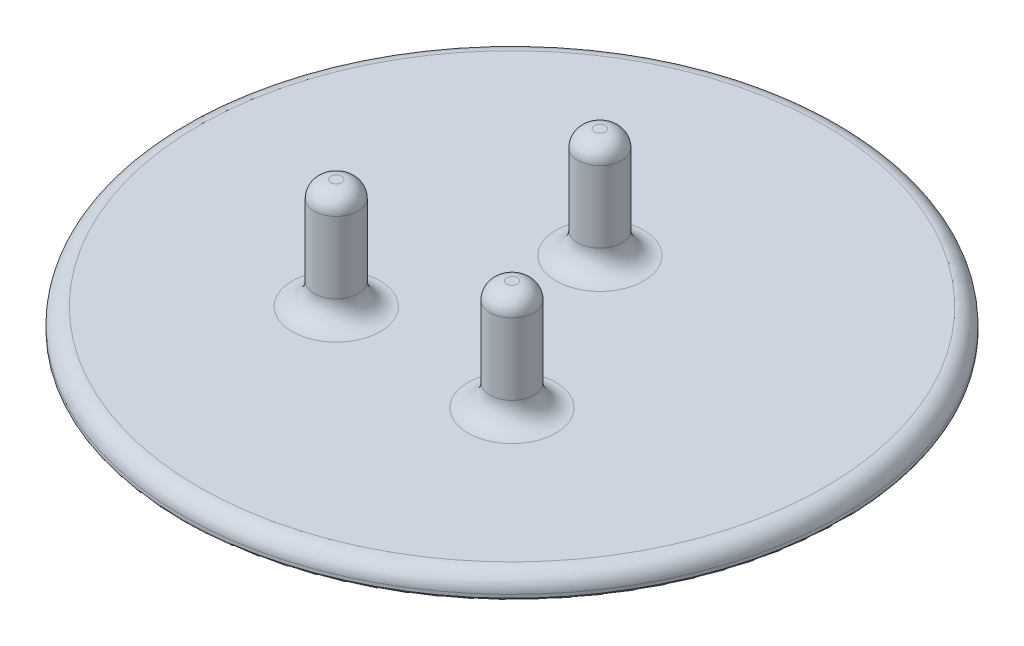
ISO-10303-21;
HEADER;
FILE_DESCRIPTION(('STEP AP214'),'2;1');
FILE_NAME('part.step','',(''),(''),'','','');
FILE_SCHEMA(('AUTOMOTIVE_DESIGN { 1 0 10303 214 1 1 1 1 }'));
ENDSEC;
DATA;
#1=APPLICATION_CONTEXT('core data for automotive mechanical design processes');
#2=APPLICATION_PROTOCOL_DEFINITION('international standard','automotive_design',2000,#1);
#3=PRODUCT_CONTEXT('',#1,'mechanical');
#4=PRODUCT('Part','Part','',(#3));
#5=PRODUCT_RELATED_PRODUCT_CATEGORY('part','',(#4));
#6=PRODUCT_DEFINITION_FORMATION('','',#4);
#7=PRODUCT_DEFINITION_CONTEXT('part definition',#1,'design');
#8=PRODUCT_DEFINITION('design','',#6,#7);
#9=PRODUCT_DEFINITION_SHAPE('','',#8);
#10=(LENGTH_UNIT() NAMED_UNIT(*) SI_UNIT(.MILLI.,.METRE.));
#11=(NAMED_UNIT(*) PLANE_ANGLE_UNIT() SI_UNIT($,.RADIAN.));
#12=(NAMED_UNIT(*) SI_UNIT($,.STERADIAN.) SOLID_ANGLE_UNIT());
#13=UNCERTAINTY_MEASURE_WITH_UNIT(LENGTH_MEASURE(1.E-05),#10,'distance_accuracy_value','');
#14=(GEOMETRIC_REPRESENTATION_CONTEXT(3) GLOBAL_UNCERTAINTY_ASSIGNED_CONTEXT((#13)) GLOBAL_UNIT_ASSIGNED_CONTEXT((#10,
#11,#12)) REPRESENTATION_CONTEXT('',''));
#15=CARTESIAN_POINT('',(0.,0.,0.));
#16=DIRECTION('',(0.,0.,1.));
#17=DIRECTION('',(1.,0.,0.));
#18=AXIS2_PLACEMENT_3D('',#15,#16,#17);
#19=CARTESIAN_POINT('',(0.,0.,0.));
#20=DIRECTION('',(0.,1.,0.));
#21=DIRECTION('',(0.,0.,1.));
#22=AXIS2_PLACEMENT_3D('',#19,#20,#21);
#23=PLANE('',#22);
#24=DIRECTION('',(0.,0.,1.));
#25=VECTOR('',#24,1.);
#26=CARTESIAN_POINT('',(-7.525,0.,-2.275));
#27=LINE('',#26,#25);
#28=CARTESIAN_POINT('',(-7.525,0.,2.475));
#29=VERTEX_POINT('',#28);
#30=CARTESIAN_POINT('',(-7.525,0.,-2.475));
#31=VERTEX_POINT('',#30);
#32=EDGE_CURVE('E546',#29,#31,#27,.F.);
#33=ORIENTED_EDGE('',*,*,#32,.T.);
#34=DIRECTION('',(1.,0.,0.));
#35=VECTOR('',#34,1.);
#36=CARTESIAN_POINT('',(-12.275,0.,-2.475));
#37=LINE('',#36,#35);
#38=CARTESIAN_POINT('',(-12.475,0.,-2.475));
#39=VERTEX_POINT('',#38);
#40=EDGE_CURVE('E301',#31,#39,#37,.F.);
#41=ORIENTED_EDGE('',*,*,#40,.T.);
#42=DIRECTION('',(0.,0.,-1.));
#43=VECTOR('',#42,1.);
#44=CARTESIAN_POINT('',(-12.475,0.,2.275));
#45=LINE('',#44,#43);
#46=CARTESIAN_POINT('',(-12.475,0.,2.475));
#47=VERTEX_POINT('',#46);
#48=EDGE_CURVE('E550',#39,#47,#45,.F.);
#49=ORIENTED_EDGE('',*,*,#48,.T.);
#50=DIRECTION('',(-1.,0.,0.));
#51=VECTOR('',#50,1.);
#52=CARTESIAN_POINT('',(-7.725,0.,2.475));
#53=LINE('',#52,#51);
#54=EDGE_CURVE('E548',#47,#29,#53,.F.);
#55=ORIENTED_EDGE('',*,*,#54,.T.);
#56=EDGE_LOOP('',(#33,#41,#49,#55));
#57=FACE_BOUND('',#56,.T.);
#58=DIRECTION('',(0.,0.,1.));
#59=VECTOR('',#58,1.);
#60=CARTESIAN_POINT('',(12.475,0.,-2.275));
#61=LINE('',#60,#59);
#62=CARTESIAN_POINT('',(12.475,0.,2.475));
#63=VERTEX_POINT('',#62);
#64=CARTESIAN_POINT('',(12.475,0.,-2.475));
#65=VERTEX_POINT('',#64);
#66=EDGE_CURVE('E555',#63,#65,#61,.F.);
#67=ORIENTED_EDGE('',*,*,#66,.T.);
#68=DIRECTION('',(1.,0.,0.));
#69=VECTOR('',#68,1.);
#70=CARTESIAN_POINT('',(7.725,0.,-2.475));
#71=LINE('',#70,#69);
#72=CARTESIAN_POINT('',(7.525,0.,-2.475));
#73=VERTEX_POINT('',#72);
#74=EDGE_CURVE('E552',#65,#73,#71,.F.);
#75=ORIENTED_EDGE('',*,*,#74,.T.);
#76=DIRECTION('',(0.,0.,-1.));
#77=VECTOR('',#76,1.);
#78=CARTESIAN_POINT('',(7.525,0.,2.275));
#79=LINE('',#78,#77);
#80=CARTESIAN_POINT('',(7.525,0.,2.475));
#81=VERTEX_POINT('',#80);
#82=EDGE_CURVE('E559',#73,#81,#79,.F.);
#83=ORIENTED_EDGE('',*,*,#82,.T.);
#84=DIRECTION('',(-1.,0.,0.));
#85=VECTOR('',#84,1.);
#86=CARTESIAN_POINT('',(12.275,0.,2.475));
#87=LINE('',#86,#85);
#88=EDGE_CURVE('E557',#81,#63,#87,.F.);
#89=ORIENTED_EDGE('',*,*,#88,.T.);
#90=EDGE_LOOP('',(#67,#75,#83,#89));
#91=FACE_BOUND('',#90,.T.);
#92=DIRECTION('',(0.,0.,1.));
#93=VECTOR('',#92,1.);
#94=CARTESIAN_POINT('',(2.475,0.,-2.275));
#95=LINE('',#94,#93);
#96=CARTESIAN_POINT('',(2.475,0.,2.475));
#97=VERTEX_POINT('',#96);
#98=CARTESIAN_POINT('',(2.475,0.,-2.475));
#99=VERTEX_POINT('',#98);
#100=EDGE_CURVE('E564',#97,#99,#95,.F.);
#101=ORIENTED_EDGE('',*,*,#100,.T.);
#102=DIRECTION('',(1.,0.,0.));
#103=VECTOR('',#102,1.);
#104=CARTESIAN_POINT('',(-2.275,0.,-2.475));
#105=LINE('',#104,#103);
#106=CARTESIAN_POINT('',(-2.475,0.,-2.475));
#107=VERTEX_POINT('',#106);
#108=EDGE_CURVE('E561',#99,#107,#105,.F.);
#109=ORIENTED_EDGE('',*,*,#108,.T.);
#110=DIRECTION('',(0.,0.,-1.));
#111=VECTOR('',#110,1.);
#112=CARTESIAN_POINT('',(-2.475,0.,2.275));
#113=LINE('',#112,#111);
#114=CARTESIAN_POINT('',(-2.475,0.,2.475));
#115=VERTEX_POINT('',#114);
#116=EDGE_CURVE('E568',#107,#115,#113,.F.);
#117=ORIENTED_EDGE('',*,*,#116,.T.);
#118=DIRECTION('',(-1.,0.,0.));
#119=VECTOR('',#118,1.);
#120=CARTESIAN_POINT('',(2.275,0.,2.475));
#121=LINE('',#120,#119);
#122=EDGE_CURVE('E566',#115,#97,#121,.F.);
#123=ORIENTED_EDGE('',*,*,#122,.T.);
#124=EDGE_LOOP('',(#101,#109,#117,#123));
#125=FACE_BOUND('',#124,.T.);
#126=CARTESIAN_POINT('',(0.,0.,0.));
#127=DIRECTION('',(0.,1.,0.));
#128=DIRECTION('',(0.,0.,1.));
#129=AXIS2_PLACEMENT_3D('',#126,#127,#128);
#130=CIRCLE('',#129,29.8);
#131=CARTESIAN_POINT('',(0.,0.,29.8));
#132=VERTEX_POINT('',#131);
#133=EDGE_CURVE('E570',#132,#132,#130,.F.);
#134=ORIENTED_EDGE('',*,*,#133,.T.);
#135=EDGE_LOOP('',(#134));
#136=FACE_BOUND('',#135,.T.);
#137=DIRECTION('',(0.,0.,-1.));
#138=VECTOR('',#137,1.);
#139=CARTESIAN_POINT('',(-2.475,0.,12.275));
#140=LINE('',#139,#138);
#141=CARTESIAN_POINT('',(-2.475,0.,7.525));
#142=VERTEX_POINT('',#141);
#143=CARTESIAN_POINT('',(-2.475,0.,12.475));
#144=VERTEX_POINT('',#143);
#145=EDGE_CURVE('E576',#142,#144,#140,.F.);
#146=ORIENTED_EDGE('',*,*,#145,.T.);
#147=DIRECTION('',(-1.,0.,0.));
#148=VECTOR('',#147,1.);
#149=CARTESIAN_POINT('',(2.275,0.,12.475));
#150=LINE('',#149,#148);
#151=CARTESIAN_POINT('',(2.475,0.,12.475));
#152=VERTEX_POINT('',#151);
#153=EDGE_CURVE('E573',#144,#152,#150,.F.);
#154=ORIENTED_EDGE('',*,*,#153,.T.);
#155=DIRECTION('',(0.,0.,1.));
#156=VECTOR('',#155,1.);
#157=CARTESIAN_POINT('',(2.475,0.,7.725));
#158=LINE('',#157,#156);
#159=CARTESIAN_POINT('',(2.475,0.,7.525));
#160=VERTEX_POINT('',#159);
#161=EDGE_CURVE('E580',#152,#160,#158,.F.);
#162=ORIENTED_EDGE('',*,*,#161,.T.);
#163=DIRECTION('',(1.,0.,0.));
#164=VECTOR('',#163,1.);
#165=CARTESIAN_POINT('',(-2.275,0.,7.525));
#166=LINE('',#165,#164);
#167=EDGE_CURVE('E578',#160,#142,#166,.F.);
#168=ORIENTED_EDGE('',*,*,#167,.T.);
#169=EDGE_LOOP('',(#146,#154,#162,#168));
#170=FACE_BOUND('',#169,.T.);
#171=DIRECTION('',(0.,0.,1.));
#172=VECTOR('',#171,1.);
#173=CARTESIAN_POINT('',(2.475,0.,-12.275));
#174=LINE('',#173,#172);
#175=CARTESIAN_POINT('',(2.475,0.,-7.525));
#176=VERTEX_POINT('',#175);
#177=CARTESIAN_POINT('',(2.475,0.,-12.475));
#178=VERTEX_POINT('',#177);
#179=EDGE_CURVE('E585',#176,#178,#174,.F.);
#180=ORIENTED_EDGE('',*,*,#179,.T.);
#181=DIRECTION('',(1.,0.,0.));
#182=VECTOR('',#181,1.);
#183=CARTESIAN_POINT('',(-2.275,0.,-12.475));
#184=LINE('',#183,#182);
#185=CARTESIAN_POINT('',(-2.475,0.,-12.475));
#186=VERTEX_POINT('',#185);
#187=EDGE_CURVE('E582',#178,#186,#184,.F.);
#188=ORIENTED_EDGE('',*,*,#187,.T.);
#189=DIRECTION('',(0.,0.,-1.));
#190=VECTOR('',#189,1.);
#191=CARTESIAN_POINT('',(-2.475,0.,-7.725));
#192=LINE('',#191,#190);
#193=CARTESIAN_POINT('',(-2.475,0.,-7.525));
#194=VERTEX_POINT('',#193);
#195=EDGE_CURVE('E589',#186,#194,#192,.F.);
#196=ORIENTED_EDGE('',*,*,#195,.T.);
#197=DIRECTION('',(-1.,0.,0.));
#198=VECTOR('',#197,1.);
#199=CARTESIAN_POINT('',(2.275,0.,-7.525));
#200=LINE('',#199,#198);
#201=EDGE_CURVE('E587',#194,#176,#200,.F.);
#202=ORIENTED_EDGE('',*,*,#201,.T.);
#203=EDGE_LOOP('',(#180,#188,#196,#202));
#204=FACE_BOUND('',#203,.T.);
#205=ADVANCED_FACE('F33',(#57,#91,#125,#136,#170,#204),#23,.F.);
#206=CARTESIAN_POINT('',(0.,2.,0.));
#207=DIRECTION('',(0.,1.,0.));
#208=DIRECTION('',(0.,0.,1.));
#209=AXIS2_PLACEMENT_3D('',#206,#207,#208);
#210=PLANE('',#209);
#211=CARTESIAN_POINT('',(0.,2.,0.));
#212=DIRECTION('',(0.,1.,0.));
#213=DIRECTION('',(0.,0.,1.));
#214=AXIS2_PLACEMENT_3D('',#211,#212,#213);
#215=CIRCLE('',#214,28.5);
#216=CARTESIAN_POINT('',(0.,2.,28.5));
#217=VERTEX_POINT('',#216);
#218=EDGE_CURVE('E612',#217,#217,#215,.T.);
#219=ORIENTED_EDGE('',*,*,#218,.T.);
#220=EDGE_LOOP('',(#219));
#221=FACE_BOUND('',#220,.T.);
#222=CARTESIAN_POINT('',(0.,2.,-8.));
#223=DIRECTION('',(0.,1.,0.));
#224=DIRECTION('',(0.,0.,1.));
#225=AXIS2_PLACEMENT_3D('',#222,#223,#224);
#226=CIRCLE('',#225,4.);
#227=CARTESIAN_POINT('',(0.,2.,-4.));
#228=VERTEX_POINT('',#227);
#229=EDGE_CURVE('E621',#228,#228,#226,.F.);
#230=ORIENTED_EDGE('',*,*,#229,.T.);
#231=EDGE_LOOP('',(#230));
#232=FACE_BOUND('',#231,.T.);
#233=CARTESIAN_POINT('',(8.,2.,8.));
#234=DIRECTION('',(0.,1.,0.));
#235=DIRECTION('',(0.,0.,1.));
#236=AXIS2_PLACEMENT_3D('',#233,#234,#235);
#237=CIRCLE('',#236,4.);
#238=CARTESIAN_POINT('',(8.,2.,12.));
#239=VERTEX_POINT('',#238);
#240=EDGE_CURVE('E624',#239,#239,#237,.F.);
#241=ORIENTED_EDGE('',*,*,#240,.T.);
#242=EDGE_LOOP('',(#241));
#243=FACE_BOUND('',#242,.T.);
#244=CARTESIAN_POINT('',(-8.,2.,8.00000000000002));
#245=DIRECTION('',(0.,1.,0.));
#246=DIRECTION('',(0.,0.,1.));
#247=AXIS2_PLACEMENT_3D('',#244,#245,#246);
#248=CIRCLE('',#247,4.);
#249=CARTESIAN_POINT('',(-8.,2.,12.));
#250=VERTEX_POINT('',#249);
#251=EDGE_CURVE('E627',#250,#250,#248,.F.);
#252=ORIENTED_EDGE('',*,*,#251,.T.);
#253=EDGE_LOOP('',(#252));
#254=FACE_BOUND('',#253,.T.);
#255=ADVANCED_FACE('F724',(#221,#232,#243,#254),#210,.T.);
#256=CARTESIAN_POINT('',(0.,2.,0.));
#257=DIRECTION('',(0.,-1.,0.));
#258=DIRECTION('',(0.,0.,-1.));
#259=AXIS2_PLACEMENT_3D('',#256,#257,#258);
#260=CYLINDRICAL_SURFACE('',#259,30.);
#261=CARTESIAN_POINT('',(0.,0.2,0.));
#262=DIRECTION('',(0.,1.,0.));
#263=DIRECTION('',(0.,0.,1.));
#264=AXIS2_PLACEMENT_3D('',#261,#262,#263);
#265=CIRCLE('',#264,30.);
#266=CARTESIAN_POINT('',(0.,0.2,30.));
#267=VERTEX_POINT('',#266);
#268=EDGE_CURVE('E496',#267,#267,#265,.T.);
#269=ORIENTED_EDGE('',*,*,#268,.T.);
#270=EDGE_LOOP('',(#269));
#271=FACE_BOUND('',#270,.T.);
#272=CARTESIAN_POINT('',(0.,0.5,0.));
#273=DIRECTION('',(0.,1.,0.));
#274=DIRECTION('',(0.,0.,1.));
#275=AXIS2_PLACEMENT_3D('',#272,#273,#274);
#276=CIRCLE('',#275,30.);
#277=CARTESIAN_POINT('',(0.,0.5,30.));
#278=VERTEX_POINT('',#277);
#279=EDGE_CURVE('E609',#278,#278,#276,.F.);
#280=ORIENTED_EDGE('',*,*,#279,.T.);
#281=EDGE_LOOP('',(#280));
#282=FACE_BOUND('',#281,.T.);
#283=ADVANCED_FACE('F730',(#271,#282),#260,.T.);
#284=CARTESIAN_POINT('',(0.,12.,-8.));
#285=DIRECTION('',(0.,-1.,0.));
#286=DIRECTION('',(0.,0.,-1.));
#287=AXIS2_PLACEMENT_3D('',#284,#285,#286);
#288=CYLINDRICAL_SURFACE('',#287,2.);
#289=CARTESIAN_POINT('',(0.,10.5,-8.));
#290=DIRECTION('',(0.,1.,0.));
#291=DIRECTION('',(0.,0.,1.));
#292=AXIS2_PLACEMENT_3D('',#289,#290,#291);
#293=CIRCLE('',#292,2.);
#294=CARTESIAN_POINT('',(0.,10.5,-6.));
#295=VERTEX_POINT('',#294);
#296=EDGE_CURVE('E597',#295,#295,#293,.F.);
#297=ORIENTED_EDGE('',*,*,#296,.T.);
#298=EDGE_LOOP('',(#297));
#299=FACE_BOUND('',#298,.T.);
#300=CARTESIAN_POINT('',(0.,4.,-8.));
#301=DIRECTION('',(0.,1.,0.));
#302=DIRECTION('',(0.,0.,1.));
#303=AXIS2_PLACEMENT_3D('',#300,#301,#302);
#304=CIRCLE('',#303,2.);
#305=CARTESIAN_POINT('',(0.,4.,-6.));
#306=VERTEX_POINT('',#305);
#307=EDGE_CURVE('E630',#306,#306,#304,.T.);
#308=ORIENTED_EDGE('',*,*,#307,.T.);
#309=EDGE_LOOP('',(#308));
#310=FACE_BOUND('',#309,.T.);
#311=ADVANCED_FACE('F738',(#299,#310),#288,.T.);
#312=CARTESIAN_POINT('',(0.,12.,-8.));
#313=DIRECTION('',(0.,1.,0.));
#314=DIRECTION('',(0.,0.,1.));
#315=AXIS2_PLACEMENT_3D('',#312,#313,#314);
#316=PLANE('',#315);
#317=CARTESIAN_POINT('',(0.,12.,-8.));
#318=DIRECTION('',(0.,1.,0.));
#319=DIRECTION('',(0.,0.,1.));
#320=AXIS2_PLACEMENT_3D('',#317,#318,#319);
#321=CIRCLE('',#320,0.5);
#322=CARTESIAN_POINT('',(0.,12.,-7.5));
#323=VERTEX_POINT('',#322);
#324=EDGE_CURVE('E600',#323,#323,#321,.T.);
#325=ORIENTED_EDGE('',*,*,#324,.T.);
#326=EDGE_LOOP('',(#325));
#327=FACE_BOUND('',#326,.T.);
#328=ADVANCED_FACE('F1375',(#327),#316,.T.);
#329=CARTESIAN_POINT('',(-8.,12.,8.00000000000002));
#330=DIRECTION('',(0.,-1.,0.));
#331=DIRECTION('',(0.,0.,-1.));
#332=AXIS2_PLACEMENT_3D('',#329,#330,#331);
#333=CYLINDRICAL_SURFACE('',#332,2.);
#334=CARTESIAN_POINT('',(-8.,10.5,8.00000000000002));
#335=DIRECTION('',(0.,1.,0.));
#336=DIRECTION('',(0.,0.,1.));
#337=AXIS2_PLACEMENT_3D('',#334,#335,#336);
#338=CIRCLE('',#337,2.);
#339=CARTESIAN_POINT('',(-8.,10.5,10.));
#340=VERTEX_POINT('',#339);
#341=EDGE_CURVE('E319',#340,#340,#338,.F.);
#342=ORIENTED_EDGE('',*,*,#341,.T.);
#343=EDGE_LOOP('',(#342));
#344=FACE_BOUND('',#343,.T.);
#345=CARTESIAN_POINT('',(-8.,4.,8.00000000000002));
#346=DIRECTION('',(0.,1.,0.));
#347=DIRECTION('',(0.,0.,1.));
#348=AXIS2_PLACEMENT_3D('',#345,#346,#347);
#349=CIRCLE('',#348,2.);
#350=CARTESIAN_POINT('',(-8.,4.,10.));
#351=VERTEX_POINT('',#350);
#352=EDGE_CURVE('E615',#351,#351,#349,.T.);
#353=ORIENTED_EDGE('',*,*,#352,.T.);
#354=EDGE_LOOP('',(#353));
#355=FACE_BOUND('',#354,.T.);
#356=ADVANCED_FACE('F1365',(#344,#355),#333,.T.);
#357=CARTESIAN_POINT('',(-8.,12.,8.00000000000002));
#358=DIRECTION('',(0.,1.,0.));
#359=DIRECTION('',(0.,0.,1.));
#360=AXIS2_PLACEMENT_3D('',#357,#358,#359);
#361=PLANE('',#360);
#362=CARTESIAN_POINT('',(-8.,12.,8.00000000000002));
#363=DIRECTION('',(0.,1.,0.));
#364=DIRECTION('',(0.,0.,1.));
#365=AXIS2_PLACEMENT_3D('',#362,#363,#364);
#366=CIRCLE('',#365,0.5);
#367=CARTESIAN_POINT('',(-8.,12.,8.50000000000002));
#368=VERTEX_POINT('',#367);
#369=EDGE_CURVE('E594',#368,#368,#366,.T.);
#370=ORIENTED_EDGE('',*,*,#369,.T.);
#371=EDGE_LOOP('',(#370));
#372=FACE_BOUND('',#371,.T.);
#373=ADVANCED_FACE('F1355',(#372),#361,.T.);
#374=CARTESIAN_POINT('',(8.,12.,8.));
#375=DIRECTION('',(0.,-1.,0.));
#376=DIRECTION('',(0.,0.,-1.));
#377=AXIS2_PLACEMENT_3D('',#374,#375,#376);
#378=CYLINDRICAL_SURFACE('',#377,2.);
#379=CARTESIAN_POINT('',(8.,10.5,8.));
#380=DIRECTION('',(0.,1.,0.));
#381=DIRECTION('',(0.,0.,1.));
#382=AXIS2_PLACEMENT_3D('',#379,#380,#381);
#383=CIRCLE('',#382,2.);
#384=CARTESIAN_POINT('',(8.,10.5,10.));
#385=VERTEX_POINT('',#384);
#386=EDGE_CURVE('E603',#385,#385,#383,.F.);
#387=ORIENTED_EDGE('',*,*,#386,.T.);
#388=EDGE_LOOP('',(#387));
#389=FACE_BOUND('',#388,.T.);
#390=CARTESIAN_POINT('',(8.,4.,8.));
#391=DIRECTION('',(0.,1.,0.));
#392=DIRECTION('',(0.,0.,1.));
#393=AXIS2_PLACEMENT_3D('',#390,#391,#392);
#394=CIRCLE('',#393,2.);
#395=CARTESIAN_POINT('',(8.,4.,10.));
#396=VERTEX_POINT('',#395);
#397=EDGE_CURVE('E618',#396,#396,#394,.T.);
#398=ORIENTED_EDGE('',*,*,#397,.T.);
#399=EDGE_LOOP('',(#398));
#400=FACE_BOUND('',#399,.T.);
#401=ADVANCED_FACE('F1344',(#389,#400),#378,.T.);
#402=CARTESIAN_POINT('',(8.,12.,8.));
#403=DIRECTION('',(0.,1.,0.));
#404=DIRECTION('',(0.,0.,1.));
#405=AXIS2_PLACEMENT_3D('',#402,#403,#404);
#406=PLANE('',#405);
#407=CARTESIAN_POINT('',(8.,12.,8.));
#408=DIRECTION('',(0.,1.,0.));
#409=DIRECTION('',(0.,0.,1.));
#410=AXIS2_PLACEMENT_3D('',#407,#408,#409);
#411=CIRCLE('',#410,0.5);
#412=CARTESIAN_POINT('',(8.,12.,8.5));
#413=VERTEX_POINT('',#412);
#414=EDGE_CURVE('E606',#413,#413,#411,.T.);
#415=ORIENTED_EDGE('',*,*,#414,.T.);
#416=EDGE_LOOP('',(#415));
#417=FACE_BOUND('',#416,.T.);
#418=ADVANCED_FACE('F744',(#417),#406,.T.);
#419=CARTESIAN_POINT('',(0.,4.,-8.));
#420=DIRECTION('',(0.,1.,0.));
#421=DIRECTION('',(0.,0.,1.));
#422=AXIS2_PLACEMENT_3D('',#419,#420,#421);
#423=TOROIDAL_SURFACE('',#422,4.,2.);
#424=ORIENTED_EDGE('',*,*,#229,.F.);
#425=EDGE_LOOP('',(#424));
#426=FACE_BOUND('',#425,.T.);
#427=ORIENTED_EDGE('',*,*,#307,.F.);
#428=EDGE_LOOP('',(#427));
#429=FACE_BOUND('',#428,.T.);
#430=ADVANCED_FACE('F740',(#426,#429),#423,.F.);
#431=CARTESIAN_POINT('',(8.,4.,8.));
#432=DIRECTION('',(0.,1.,0.));
#433=DIRECTION('',(0.,0.,1.));
#434=AXIS2_PLACEMENT_3D('',#431,#432,#433);
#435=TOROIDAL_SURFACE('',#434,4.,2.);
#436=ORIENTED_EDGE('',*,*,#240,.F.);
#437=EDGE_LOOP('',(#436));
#438=FACE_BOUND('',#437,.T.);
#439=ORIENTED_EDGE('',*,*,#397,.F.);
#440=EDGE_LOOP('',(#439));
#441=FACE_BOUND('',#440,.T.);
#442=ADVANCED_FACE('F743',(#438,#441),#435,.F.);
#443=CARTESIAN_POINT('',(-8.,4.,8.00000000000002));
#444=DIRECTION('',(0.,1.,0.));
#445=DIRECTION('',(0.,0.,1.));
#446=AXIS2_PLACEMENT_3D('',#443,#444,#445);
#447=TOROIDAL_SURFACE('',#446,4.,2.);
#448=ORIENTED_EDGE('',*,*,#251,.F.);
#449=EDGE_LOOP('',(#448));
#450=FACE_BOUND('',#449,.T.);
#451=ORIENTED_EDGE('',*,*,#352,.F.);
#452=EDGE_LOOP('',(#451));
#453=FACE_BOUND('',#452,.T.);
#454=ADVANCED_FACE('F748',(#450,#453),#447,.F.);
#455=CARTESIAN_POINT('',(0.,0.5,0.));
#456=DIRECTION('',(0.,1.,0.));
#457=DIRECTION('',(0.,0.,1.));
#458=AXIS2_PLACEMENT_3D('',#455,#456,#457);
#459=TOROIDAL_SURFACE('',#458,28.5,1.5);
#460=ORIENTED_EDGE('',*,*,#279,.F.);
#461=EDGE_LOOP('',(#460));
#462=FACE_BOUND('',#461,.T.);
#463=ORIENTED_EDGE('',*,*,#218,.F.);
#464=EDGE_LOOP('',(#463));
#465=FACE_BOUND('',#464,.T.);
#466=ADVANCED_FACE('F752',(#462,#465),#459,.T.);
#467=CARTESIAN_POINT('',(8.,10.5,8.));
#468=DIRECTION('',(0.,1.,0.));
#469=DIRECTION('',(0.,0.,1.));
#470=AXIS2_PLACEMENT_3D('',#467,#468,#469);
#471=DEGENERATE_TOROIDAL_SURFACE('',#470,0.5,1.5,.T.);
#472=ORIENTED_EDGE('',*,*,#386,.F.);
#473=EDGE_LOOP('',(#472));
#474=FACE_BOUND('',#473,.T.);
#475=ORIENTED_EDGE('',*,*,#414,.F.);
#476=EDGE_LOOP('',(#475));
#477=FACE_BOUND('',#476,.T.);
#478=ADVANCED_FACE('F756',(#474,#477),#471,.T.);
#479=CARTESIAN_POINT('',(0.,10.5,-8.));
#480=DIRECTION('',(0.,1.,0.));
#481=DIRECTION('',(0.,0.,1.));
#482=AXIS2_PLACEMENT_3D('',#479,#480,#481);
#483=DEGENERATE_TOROIDAL_SURFACE('',#482,0.5,1.5,.T.);
#484=ORIENTED_EDGE('',*,*,#296,.F.);
#485=EDGE_LOOP('',(#484));
#486=FACE_BOUND('',#485,.T.);
#487=ORIENTED_EDGE('',*,*,#324,.F.);
#488=EDGE_LOOP('',(#487));
#489=FACE_BOUND('',#488,.T.);
#490=ADVANCED_FACE('F760',(#486,#489),#483,.T.);
#491=CARTESIAN_POINT('',(-8.,10.5,8.00000000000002));
#492=DIRECTION('',(0.,1.,0.));
#493=DIRECTION('',(0.,0.,1.));
#494=AXIS2_PLACEMENT_3D('',#491,#492,#493);
#495=DEGENERATE_TOROIDAL_SURFACE('',#494,0.5,1.5,.T.);
#496=ORIENTED_EDGE('',*,*,#341,.F.);
#497=EDGE_LOOP('',(#496));
#498=FACE_BOUND('',#497,.T.);
#499=ORIENTED_EDGE('',*,*,#369,.F.);
#500=EDGE_LOOP('',(#499));
#501=FACE_BOUND('',#500,.T.);
#502=ADVANCED_FACE('F764',(#498,#501),#495,.T.);
#503=CARTESIAN_POINT('',(-2.275,-2.3,-2.275));
#504=DIRECTION('',(1.,0.,0.));
#505=DIRECTION('',(0.,0.,-1.));
#506=AXIS2_PLACEMENT_3D('',#503,#504,#505);
#507=PLANE('',#506);
#508=DIRECTION('',(0.,1.,0.));
#509=VECTOR('',#508,1.);
#510=CARTESIAN_POINT('',(-2.275,-2.3,2.275));
#511=LINE('',#510,#509);
#512=CARTESIAN_POINT('',(-2.275,-2.1,2.275));
#513=VERTEX_POINT('',#512);
#514=CARTESIAN_POINT('',(-2.275,-0.2,2.275));
#515=VERTEX_POINT('',#514);
#516=EDGE_CURVE('E642',#513,#515,#511,.T.);
#517=ORIENTED_EDGE('',*,*,#516,.T.);
#518=DIRECTION('',(0.,0.,-1.));
#519=VECTOR('',#518,1.);
#520=CARTESIAN_POINT('',(-2.275,-0.2,-2.275));
#521=LINE('',#520,#519);
#522=CARTESIAN_POINT('',(-2.275,-0.2,-2.275));
#523=VERTEX_POINT('',#522);
#524=EDGE_CURVE('E499',#515,#523,#521,.T.);
#525=ORIENTED_EDGE('',*,*,#524,.T.);
#526=DIRECTION('',(0.,1.,0.));
#527=VECTOR('',#526,1.);
#528=CARTESIAN_POINT('',(-2.275,-2.3,-2.275));
#529=LINE('',#528,#527);
#530=CARTESIAN_POINT('',(-2.275,-2.1,-2.275));
#531=VERTEX_POINT('',#530);
#532=EDGE_CURVE('E633',#531,#523,#529,.T.);
#533=ORIENTED_EDGE('',*,*,#532,.F.);
#534=DIRECTION('',(0.,0.,-1.));
#535=VECTOR('',#534,1.);
#536=CARTESIAN_POINT('',(-2.275,-2.1,2.275));
#537=LINE('',#536,#535);
#538=EDGE_CURVE('E501',#531,#513,#537,.F.);
#539=ORIENTED_EDGE('',*,*,#538,.T.);
#540=EDGE_LOOP('',(#517,#525,#533,#539));
#541=FACE_BOUND('',#540,.T.);
#542=ADVANCED_FACE('F768',(#541),#507,.F.);
#543=CARTESIAN_POINT('',(2.275,-2.3,-2.275));
#544=DIRECTION('',(0.,0.,1.));
#545=DIRECTION('',(1.,0.,0.));
#546=AXIS2_PLACEMENT_3D('',#543,#544,#545);
#547=PLANE('',#546);
#548=ORIENTED_EDGE('',*,*,#532,.T.);
#549=DIRECTION('',(1.,0.,0.));
#550=VECTOR('',#549,1.);
#551=CARTESIAN_POINT('',(2.275,-0.2,-2.275));
#552=LINE('',#551,#550);
#553=CARTESIAN_POINT('',(2.275,-0.2,-2.275));
#554=VERTEX_POINT('',#553);
#555=EDGE_CURVE('E512',#523,#554,#552,.T.);
#556=ORIENTED_EDGE('',*,*,#555,.T.);
#557=DIRECTION('',(0.,1.,0.));
#558=VECTOR('',#557,1.);
#559=CARTESIAN_POINT('',(2.275,-2.3,-2.275));
#560=LINE('',#559,#558);
#561=CARTESIAN_POINT('',(2.275,-2.1,-2.275));
#562=VERTEX_POINT('',#561);
#563=EDGE_CURVE('E636',#562,#554,#560,.T.);
#564=ORIENTED_EDGE('',*,*,#563,.F.);
#565=DIRECTION('',(1.,0.,0.));
#566=VECTOR('',#565,1.);
#567=CARTESIAN_POINT('',(-2.275,-2.1,-2.275));
#568=LINE('',#567,#566);
#569=EDGE_CURVE('E515',#562,#531,#568,.F.);
#570=ORIENTED_EDGE('',*,*,#569,.T.);
#571=EDGE_LOOP('',(#548,#556,#564,#570));
#572=FACE_BOUND('',#571,.T.);
#573=ADVANCED_FACE('F1279',(#572),#547,.F.);
#574=CARTESIAN_POINT('',(2.275,-2.3,-2.275));
#575=DIRECTION('',(-1.,0.,0.));
#576=DIRECTION('',(0.,0.,1.));
#577=AXIS2_PLACEMENT_3D('',#574,#575,#576);
#578=PLANE('',#577);
#579=ORIENTED_EDGE('',*,*,#563,.T.);
#580=DIRECTION('',(0.,0.,1.));
#581=VECTOR('',#580,1.);
#582=CARTESIAN_POINT('',(2.275,-0.2,2.275));
#583=LINE('',#582,#581);
#584=CARTESIAN_POINT('',(2.275,-0.2,2.275));
#585=VERTEX_POINT('',#584);
#586=EDGE_CURVE('E508',#554,#585,#583,.T.);
#587=ORIENTED_EDGE('',*,*,#586,.T.);
#588=DIRECTION('',(0.,1.,0.));
#589=VECTOR('',#588,1.);
#590=CARTESIAN_POINT('',(2.275,-2.3,2.275));
#591=LINE('',#590,#589);
#592=CARTESIAN_POINT('',(2.275,-2.1,2.275));
#593=VERTEX_POINT('',#592);
#594=EDGE_CURVE('E639',#593,#585,#591,.T.);
#595=ORIENTED_EDGE('',*,*,#594,.F.);
#596=DIRECTION('',(0.,0.,1.));
#597=VECTOR('',#596,1.);
#598=CARTESIAN_POINT('',(2.275,-2.1,-2.275));
#599=LINE('',#598,#597);
#600=EDGE_CURVE('E510',#593,#562,#599,.F.);
#601=ORIENTED_EDGE('',*,*,#600,.T.);
#602=EDGE_LOOP('',(#579,#587,#595,#601));
#603=FACE_BOUND('',#602,.T.);
#604=ADVANCED_FACE('F1269',(#603),#578,.F.);
#605=CARTESIAN_POINT('',(2.275,-2.3,2.275));
#606=DIRECTION('',(0.,0.,-1.));
#607=DIRECTION('',(-1.,0.,0.));
#608=AXIS2_PLACEMENT_3D('',#605,#606,#607);
#609=PLANE('',#608);
#610=ORIENTED_EDGE('',*,*,#594,.T.);
#611=DIRECTION('',(-1.,0.,0.));
#612=VECTOR('',#611,1.);
#613=CARTESIAN_POINT('',(-2.275,-0.2,2.275));
#614=LINE('',#613,#612);
#615=EDGE_CURVE('E503',#585,#515,#614,.T.);
#616=ORIENTED_EDGE('',*,*,#615,.T.);
#617=ORIENTED_EDGE('',*,*,#516,.F.);
#618=DIRECTION('',(-1.,0.,0.));
#619=VECTOR('',#618,1.);
#620=CARTESIAN_POINT('',(2.275,-2.1,2.275));
#621=LINE('',#620,#619);
#622=EDGE_CURVE('E505',#513,#593,#621,.F.);
#623=ORIENTED_EDGE('',*,*,#622,.T.);
#624=EDGE_LOOP('',(#610,#616,#617,#623));
#625=FACE_BOUND('',#624,.T.);
#626=ADVANCED_FACE('F1259',(#625),#609,.F.);
#627=CARTESIAN_POINT('',(0.,-2.3,0.));
#628=DIRECTION('',(0.,-1.,0.));
#629=DIRECTION('',(0.,0.,-1.));
#630=AXIS2_PLACEMENT_3D('',#627,#628,#629);
#631=PLANE('',#630);
#632=DIRECTION('',(0.,0.,1.));
#633=VECTOR('',#632,1.);
#634=CARTESIAN_POINT('',(2.075,-2.3,2.275));
#635=LINE('',#634,#633);
#636=CARTESIAN_POINT('',(2.075,-2.3,-2.075));
#637=VERTEX_POINT('',#636);
#638=CARTESIAN_POINT('',(2.075,-2.3,2.075));
#639=VERTEX_POINT('',#638);
#640=EDGE_CURVE('E427',#637,#639,#635,.T.);
#641=ORIENTED_EDGE('',*,*,#640,.T.);
#642=DIRECTION('',(-1.,0.,0.));
#643=VECTOR('',#642,1.);
#644=CARTESIAN_POINT('',(-2.275,-2.3,2.075));
#645=LINE('',#644,#643);
#646=CARTESIAN_POINT('',(-2.075,-2.3,2.075));
#647=VERTEX_POINT('',#646);
#648=EDGE_CURVE('E424',#639,#647,#645,.T.);
#649=ORIENTED_EDGE('',*,*,#648,.T.);
#650=DIRECTION('',(0.,0.,-1.));
#651=VECTOR('',#650,1.);
#652=CARTESIAN_POINT('',(-2.075,-2.3,-2.275));
#653=LINE('',#652,#651);
#654=CARTESIAN_POINT('',(-2.075,-2.3,-2.075));
#655=VERTEX_POINT('',#654);
#656=EDGE_CURVE('E431',#647,#655,#653,.T.);
#657=ORIENTED_EDGE('',*,*,#656,.T.);
#658=DIRECTION('',(1.,0.,0.));
#659=VECTOR('',#658,1.);
#660=CARTESIAN_POINT('',(2.275,-2.3,-2.075));
#661=LINE('',#660,#659);
#662=EDGE_CURVE('E429',#655,#637,#661,.T.);
#663=ORIENTED_EDGE('',*,*,#662,.T.);
#664=EDGE_LOOP('',(#641,#649,#657,#663));
#665=FACE_BOUND('',#664,.T.);
#666=ADVANCED_FACE('F1249',(#665),#631,.T.);
#667=CARTESIAN_POINT('',(2.275,-2.3,12.275));
#668=DIRECTION('',(-1.,0.,0.));
#669=DIRECTION('',(0.,0.,1.));
#670=AXIS2_PLACEMENT_3D('',#667,#668,#669);
#671=PLANE('',#670);
#672=DIRECTION('',(0.,1.,0.));
#673=VECTOR('',#672,1.);
#674=CARTESIAN_POINT('',(2.275,-2.3,7.725));
#675=LINE('',#674,#673);
#676=CARTESIAN_POINT('',(2.275,-2.1,7.725));
#677=VERTEX_POINT('',#676);
#678=CARTESIAN_POINT('',(2.275,-0.2,7.725));
#679=VERTEX_POINT('',#678);
#680=EDGE_CURVE('E654',#677,#679,#675,.T.);
#681=ORIENTED_EDGE('',*,*,#680,.T.);
#682=DIRECTION('',(0.,0.,1.));
#683=VECTOR('',#682,1.);
#684=CARTESIAN_POINT('',(2.275,-0.2,12.275));
#685=LINE('',#684,#683);
#686=CARTESIAN_POINT('',(2.275,-0.2,12.275));
#687=VERTEX_POINT('',#686);
#688=EDGE_CURVE('E478',#679,#687,#685,.T.);
#689=ORIENTED_EDGE('',*,*,#688,.T.);
#690=DIRECTION('',(0.,1.,0.));
#691=VECTOR('',#690,1.);
#692=CARTESIAN_POINT('',(2.275,-2.3,12.275));
#693=LINE('',#692,#691);
#694=CARTESIAN_POINT('',(2.275,-2.1,12.275));
#695=VERTEX_POINT('',#694);
#696=EDGE_CURVE('E645',#695,#687,#693,.T.);
#697=ORIENTED_EDGE('',*,*,#696,.F.);
#698=DIRECTION('',(0.,0.,1.));
#699=VECTOR('',#698,1.);
#700=CARTESIAN_POINT('',(2.275,-2.1,7.725));
#701=LINE('',#700,#699);
#702=EDGE_CURVE('E480',#695,#677,#701,.F.);
#703=ORIENTED_EDGE('',*,*,#702,.T.);
#704=EDGE_LOOP('',(#681,#689,#697,#703));
#705=FACE_BOUND('',#704,.T.);
#706=ADVANCED_FACE('F1239',(#705),#671,.F.);
#707=CARTESIAN_POINT('',(-2.275,-2.3,12.275));
#708=DIRECTION('',(0.,0.,-1.));
#709=DIRECTION('',(-1.,0.,0.));
#710=AXIS2_PLACEMENT_3D('',#707,#708,#709);
#711=PLANE('',#710);
#712=ORIENTED_EDGE('',*,*,#696,.T.);
#713=DIRECTION('',(-1.,0.,0.));
#714=VECTOR('',#713,1.);
#715=CARTESIAN_POINT('',(-2.275,-0.2,12.275));
#716=LINE('',#715,#714);
#717=CARTESIAN_POINT('',(-2.275,-0.2,12.275));
#718=VERTEX_POINT('',#717);
#719=EDGE_CURVE('E491',#687,#718,#716,.T.);
#720=ORIENTED_EDGE('',*,*,#719,.T.);
#721=DIRECTION('',(0.,1.,0.));
#722=VECTOR('',#721,1.);
#723=CARTESIAN_POINT('',(-2.275,-2.3,12.275));
#724=LINE('',#723,#722);
#725=CARTESIAN_POINT('',(-2.275,-2.1,12.275));
#726=VERTEX_POINT('',#725);
#727=EDGE_CURVE('E648',#726,#718,#724,.T.);
#728=ORIENTED_EDGE('',*,*,#727,.F.);
#729=DIRECTION('',(-1.,0.,0.));
#730=VECTOR('',#729,1.);
#731=CARTESIAN_POINT('',(2.275,-2.1,12.275));
#732=LINE('',#731,#730);
#733=EDGE_CURVE('E494',#726,#695,#732,.F.);
#734=ORIENTED_EDGE('',*,*,#733,.T.);
#735=EDGE_LOOP('',(#712,#720,#728,#734));
#736=FACE_BOUND('',#735,.T.);
#737=ADVANCED_FACE('F1229',(#736),#711,.F.);
#738=CARTESIAN_POINT('',(-2.275,-2.3,12.275));
#739=DIRECTION('',(1.,0.,0.));
#740=DIRECTION('',(0.,0.,-1.));
#741=AXIS2_PLACEMENT_3D('',#738,#739,#740);
#742=PLANE('',#741);
#743=ORIENTED_EDGE('',*,*,#727,.T.);
#744=DIRECTION('',(0.,0.,-1.));
#745=VECTOR('',#744,1.);
#746=CARTESIAN_POINT('',(-2.275,-0.2,7.725));
#747=LINE('',#746,#745);
#748=CARTESIAN_POINT('',(-2.275,-0.2,7.725));
#749=VERTEX_POINT('',#748);
#750=EDGE_CURVE('E487',#718,#749,#747,.T.);
#751=ORIENTED_EDGE('',*,*,#750,.T.);
#752=DIRECTION('',(0.,1.,0.));
#753=VECTOR('',#752,1.);
#754=CARTESIAN_POINT('',(-2.275,-2.3,7.725));
#755=LINE('',#754,#753);
#756=CARTESIAN_POINT('',(-2.275,-2.1,7.725));
#757=VERTEX_POINT('',#756);
#758=EDGE_CURVE('E651',#757,#749,#755,.T.);
#759=ORIENTED_EDGE('',*,*,#758,.F.);
#760=DIRECTION('',(0.,0.,-1.));
#761=VECTOR('',#760,1.);
#762=CARTESIAN_POINT('',(-2.275,-2.1,12.275));
#763=LINE('',#762,#761);
#764=EDGE_CURVE('E489',#757,#726,#763,.F.);
#765=ORIENTED_EDGE('',*,*,#764,.T.);
#766=EDGE_LOOP('',(#743,#751,#759,#765));
#767=FACE_BOUND('',#766,.T.);
#768=ADVANCED_FACE('F1219',(#767),#742,.F.);
#769=CARTESIAN_POINT('',(-2.275,-2.3,7.725));
#770=DIRECTION('',(0.,0.,1.));
#771=DIRECTION('',(1.,0.,0.));
#772=AXIS2_PLACEMENT_3D('',#769,#770,#771);
#773=PLANE('',#772);
#774=ORIENTED_EDGE('',*,*,#758,.T.);
#775=DIRECTION('',(1.,0.,0.));
#776=VECTOR('',#775,1.);
#777=CARTESIAN_POINT('',(2.275,-0.2,7.725));
#778=LINE('',#777,#776);
#779=EDGE_CURVE('E482',#749,#679,#778,.T.);
#780=ORIENTED_EDGE('',*,*,#779,.T.);
#781=ORIENTED_EDGE('',*,*,#680,.F.);
#782=DIRECTION('',(1.,0.,0.));
#783=VECTOR('',#782,1.);
#784=CARTESIAN_POINT('',(-2.275,-2.1,7.725));
#785=LINE('',#784,#783);
#786=EDGE_CURVE('E484',#677,#757,#785,.F.);
#787=ORIENTED_EDGE('',*,*,#786,.T.);
#788=EDGE_LOOP('',(#774,#780,#781,#787));
#789=FACE_BOUND('',#788,.T.);
#790=ADVANCED_FACE('F1209',(#789),#773,.F.);
#791=CARTESIAN_POINT('',(0.,-2.3,0.));
#792=DIRECTION('',(0.,-1.,0.));
#793=DIRECTION('',(0.,0.,-1.));
#794=AXIS2_PLACEMENT_3D('',#791,#792,#793);
#795=PLANE('',#794);
#796=DIRECTION('',(0.,0.,-1.));
#797=VECTOR('',#796,1.);
#798=CARTESIAN_POINT('',(-2.075,-2.3,7.725));
#799=LINE('',#798,#797);
#800=CARTESIAN_POINT('',(-2.075,-2.3,12.075));
#801=VERTEX_POINT('',#800);
#802=CARTESIAN_POINT('',(-2.075,-2.3,7.925));
#803=VERTEX_POINT('',#802);
#804=EDGE_CURVE('E436',#801,#803,#799,.T.);
#805=ORIENTED_EDGE('',*,*,#804,.T.);
#806=DIRECTION('',(1.,0.,0.));
#807=VECTOR('',#806,1.);
#808=CARTESIAN_POINT('',(2.275,-2.3,7.925));
#809=LINE('',#808,#807);
#810=CARTESIAN_POINT('',(2.075,-2.3,7.925));
#811=VERTEX_POINT('',#810);
#812=EDGE_CURVE('E433',#803,#811,#809,.T.);
#813=ORIENTED_EDGE('',*,*,#812,.T.);
#814=DIRECTION('',(0.,0.,1.));
#815=VECTOR('',#814,1.);
#816=CARTESIAN_POINT('',(2.075,-2.3,12.275));
#817=LINE('',#816,#815);
#818=CARTESIAN_POINT('',(2.075,-2.3,12.075));
#819=VERTEX_POINT('',#818);
#820=EDGE_CURVE('E440',#811,#819,#817,.T.);
#821=ORIENTED_EDGE('',*,*,#820,.T.);
#822=DIRECTION('',(-1.,0.,0.));
#823=VECTOR('',#822,1.);
#824=CARTESIAN_POINT('',(-2.275,-2.3,12.075));
#825=LINE('',#824,#823);
#826=EDGE_CURVE('E438',#819,#801,#825,.T.);
#827=ORIENTED_EDGE('',*,*,#826,.T.);
#828=EDGE_LOOP('',(#805,#813,#821,#827));
#829=FACE_BOUND('',#828,.T.);
#830=ADVANCED_FACE('F1199',(#829),#795,.T.);
#831=CARTESIAN_POINT('',(7.725,-2.3,-2.275));
#832=DIRECTION('',(1.,0.,0.));
#833=DIRECTION('',(0.,0.,-1.));
#834=AXIS2_PLACEMENT_3D('',#831,#832,#833);
#835=PLANE('',#834);
#836=DIRECTION('',(0.,1.,0.));
#837=VECTOR('',#836,1.);
#838=CARTESIAN_POINT('',(7.725,-2.3,2.275));
#839=LINE('',#838,#837);
#840=CARTESIAN_POINT('',(7.725,-2.1,2.275));
#841=VERTEX_POINT('',#840);
#842=CARTESIAN_POINT('',(7.725,-0.2,2.275));
#843=VERTEX_POINT('',#842);
#844=EDGE_CURVE('E666',#841,#843,#839,.T.);
#845=ORIENTED_EDGE('',*,*,#844,.T.);
#846=DIRECTION('',(0.,0.,-1.));
#847=VECTOR('',#846,1.);
#848=CARTESIAN_POINT('',(7.725,-0.2,-2.275));
#849=LINE('',#848,#847);
#850=CARTESIAN_POINT('',(7.725,-0.2,-2.275));
#851=VERTEX_POINT('',#850);
#852=EDGE_CURVE('E517',#843,#851,#849,.T.);
#853=ORIENTED_EDGE('',*,*,#852,.T.);
#854=DIRECTION('',(0.,1.,0.));
#855=VECTOR('',#854,1.);
#856=CARTESIAN_POINT('',(7.725,-2.3,-2.275));
#857=LINE('',#856,#855);
#858=CARTESIAN_POINT('',(7.725,-2.1,-2.275));
#859=VERTEX_POINT('',#858);
#860=EDGE_CURVE('E657',#859,#851,#857,.T.);
#861=ORIENTED_EDGE('',*,*,#860,.F.);
#862=DIRECTION('',(0.,0.,-1.));
#863=VECTOR('',#862,1.);
#864=CARTESIAN_POINT('',(7.725,-2.1,2.275));
#865=LINE('',#864,#863);
#866=EDGE_CURVE('E519',#859,#841,#865,.F.);
#867=ORIENTED_EDGE('',*,*,#866,.T.);
#868=EDGE_LOOP('',(#845,#853,#861,#867));
#869=FACE_BOUND('',#868,.T.);
#870=ADVANCED_FACE('F1189',(#869),#835,.F.);
#871=CARTESIAN_POINT('',(12.275,-2.3,-2.275));
#872=DIRECTION('',(0.,0.,1.));
#873=DIRECTION('',(1.,0.,0.));
#874=AXIS2_PLACEMENT_3D('',#871,#872,#873);
#875=PLANE('',#874);
#876=ORIENTED_EDGE('',*,*,#860,.T.);
#877=DIRECTION('',(1.,0.,0.));
#878=VECTOR('',#877,1.);
#879=CARTESIAN_POINT('',(12.275,-0.2,-2.275));
#880=LINE('',#879,#878);
#881=CARTESIAN_POINT('',(12.275,-0.2,-2.275));
#882=VERTEX_POINT('',#881);
#883=EDGE_CURVE('E530',#851,#882,#880,.T.);
#884=ORIENTED_EDGE('',*,*,#883,.T.);
#885=DIRECTION('',(0.,1.,0.));
#886=VECTOR('',#885,1.);
#887=CARTESIAN_POINT('',(12.275,-2.3,-2.275));
#888=LINE('',#887,#886);
#889=CARTESIAN_POINT('',(12.275,-2.1,-2.275));
#890=VERTEX_POINT('',#889);
#891=EDGE_CURVE('E660',#890,#882,#888,.T.);
#892=ORIENTED_EDGE('',*,*,#891,.F.);
#893=DIRECTION('',(1.,0.,0.));
#894=VECTOR('',#893,1.);
#895=CARTESIAN_POINT('',(7.725,-2.1,-2.275));
#896=LINE('',#895,#894);
#897=EDGE_CURVE('E533',#890,#859,#896,.F.);
#898=ORIENTED_EDGE('',*,*,#897,.T.);
#899=EDGE_LOOP('',(#876,#884,#892,#898));
#900=FACE_BOUND('',#899,.T.);
#901=ADVANCED_FACE('F1179',(#900),#875,.F.);
#902=CARTESIAN_POINT('',(12.275,-2.3,-2.275));
#903=DIRECTION('',(-1.,0.,0.));
#904=DIRECTION('',(0.,0.,1.));
#905=AXIS2_PLACEMENT_3D('',#902,#903,#904);
#906=PLANE('',#905);
#907=ORIENTED_EDGE('',*,*,#891,.T.);
#908=DIRECTION('',(0.,0.,1.));
#909=VECTOR('',#908,1.);
#910=CARTESIAN_POINT('',(12.275,-0.2,2.275));
#911=LINE('',#910,#909);
#912=CARTESIAN_POINT('',(12.275,-0.2,2.275));
#913=VERTEX_POINT('',#912);
#914=EDGE_CURVE('E526',#882,#913,#911,.T.);
#915=ORIENTED_EDGE('',*,*,#914,.T.);
#916=DIRECTION('',(0.,1.,0.));
#917=VECTOR('',#916,1.);
#918=CARTESIAN_POINT('',(12.275,-2.3,2.275));
#919=LINE('',#918,#917);
#920=CARTESIAN_POINT('',(12.275,-2.1,2.275));
#921=VERTEX_POINT('',#920);
#922=EDGE_CURVE('E663',#921,#913,#919,.T.);
#923=ORIENTED_EDGE('',*,*,#922,.F.);
#924=DIRECTION('',(0.,0.,1.));
#925=VECTOR('',#924,1.);
#926=CARTESIAN_POINT('',(12.275,-2.1,-2.275));
#927=LINE('',#926,#925);
#928=EDGE_CURVE('E528',#921,#890,#927,.F.);
#929=ORIENTED_EDGE('',*,*,#928,.T.);
#930=EDGE_LOOP('',(#907,#915,#923,#929));
#931=FACE_BOUND('',#930,.T.);
#932=ADVANCED_FACE('F1169',(#931),#906,.F.);
#933=CARTESIAN_POINT('',(12.275,-2.3,2.275));
#934=DIRECTION('',(0.,0.,-1.));
#935=DIRECTION('',(-1.,0.,0.));
#936=AXIS2_PLACEMENT_3D('',#933,#934,#935);
#937=PLANE('',#936);
#938=ORIENTED_EDGE('',*,*,#922,.T.);
#939=DIRECTION('',(-1.,0.,0.));
#940=VECTOR('',#939,1.);
#941=CARTESIAN_POINT('',(7.725,-0.2,2.275));
#942=LINE('',#941,#940);
#943=EDGE_CURVE('E521',#913,#843,#942,.T.);
#944=ORIENTED_EDGE('',*,*,#943,.T.);
#945=ORIENTED_EDGE('',*,*,#844,.F.);
#946=DIRECTION('',(-1.,0.,0.));
#947=VECTOR('',#946,1.);
#948=CARTESIAN_POINT('',(12.275,-2.1,2.275));
#949=LINE('',#948,#947);
#950=EDGE_CURVE('E523',#841,#921,#949,.F.);
#951=ORIENTED_EDGE('',*,*,#950,.T.);
#952=EDGE_LOOP('',(#938,#944,#945,#951));
#953=FACE_BOUND('',#952,.T.);
#954=ADVANCED_FACE('F1159',(#953),#937,.F.);
#955=CARTESIAN_POINT('',(0.,-2.3,0.));
#956=DIRECTION('',(0.,-1.,0.));
#957=DIRECTION('',(0.,0.,-1.));
#958=AXIS2_PLACEMENT_3D('',#955,#956,#957);
#959=PLANE('',#958);
#960=DIRECTION('',(0.,0.,1.));
#961=VECTOR('',#960,1.);
#962=CARTESIAN_POINT('',(12.075,-2.3,2.275));
#963=LINE('',#962,#961);
#964=CARTESIAN_POINT('',(12.075,-2.3,-2.075));
#965=VERTEX_POINT('',#964);
#966=CARTESIAN_POINT('',(12.075,-2.3,2.075));
#967=VERTEX_POINT('',#966);
#968=EDGE_CURVE('E445',#965,#967,#963,.T.);
#969=ORIENTED_EDGE('',*,*,#968,.T.);
#970=DIRECTION('',(-1.,0.,0.));
#971=VECTOR('',#970,1.);
#972=CARTESIAN_POINT('',(7.725,-2.3,2.075));
#973=LINE('',#972,#971);
#974=CARTESIAN_POINT('',(7.925,-2.3,2.075));
#975=VERTEX_POINT('',#974);
#976=EDGE_CURVE('E442',#967,#975,#973,.T.);
#977=ORIENTED_EDGE('',*,*,#976,.T.);
#978=DIRECTION('',(0.,0.,-1.));
#979=VECTOR('',#978,1.);
#980=CARTESIAN_POINT('',(7.925,-2.3,-2.275));
#981=LINE('',#980,#979);
#982=CARTESIAN_POINT('',(7.925,-2.3,-2.075));
#983=VERTEX_POINT('',#982);
#984=EDGE_CURVE('E449',#975,#983,#981,.T.);
#985=ORIENTED_EDGE('',*,*,#984,.T.);
#986=DIRECTION('',(1.,0.,0.));
#987=VECTOR('',#986,1.);
#988=CARTESIAN_POINT('',(12.275,-2.3,-2.075));
#989=LINE('',#988,#987);
#990=EDGE_CURVE('E447',#983,#965,#989,.T.);
#991=ORIENTED_EDGE('',*,*,#990,.T.);
#992=EDGE_LOOP('',(#969,#977,#985,#991));
#993=FACE_BOUND('',#992,.T.);
#994=ADVANCED_FACE('F1149',(#993),#959,.T.);
#995=CARTESIAN_POINT('',(-2.275,-2.3,-12.275));
#996=DIRECTION('',(1.,0.,0.));
#997=DIRECTION('',(0.,0.,-1.));
#998=AXIS2_PLACEMENT_3D('',#995,#996,#997);
#999=PLANE('',#998);
#1000=DIRECTION('',(0.,1.,0.));
#1001=VECTOR('',#1000,1.);
#1002=CARTESIAN_POINT('',(-2.275,-2.3,-7.725));
#1003=LINE('',#1002,#1001);
#1004=CARTESIAN_POINT('',(-2.275,-2.1,-7.725));
#1005=VERTEX_POINT('',#1004);
#1006=CARTESIAN_POINT('',(-2.275,-0.2,-7.725));
#1007=VERTEX_POINT('',#1006);
#1008=EDGE_CURVE('E678',#1005,#1007,#1003,.T.);
#1009=ORIENTED_EDGE('',*,*,#1008,.T.);
#1010=DIRECTION('',(0.,0.,-1.));
#1011=VECTOR('',#1010,1.);
#1012=CARTESIAN_POINT('',(-2.275,-0.2,-12.275));
#1013=LINE('',#1012,#1011);
#1014=CARTESIAN_POINT('',(-2.275,-0.2,-12.275));
#1015=VERTEX_POINT('',#1014);
#1016=EDGE_CURVE('E460',#1007,#1015,#1013,.T.);
#1017=ORIENTED_EDGE('',*,*,#1016,.T.);
#1018=DIRECTION('',(0.,1.,0.));
#1019=VECTOR('',#1018,1.);
#1020=CARTESIAN_POINT('',(-2.275,-2.3,-12.275));
#1021=LINE('',#1020,#1019);
#1022=CARTESIAN_POINT('',(-2.275,-2.1,-12.275));
#1023=VERTEX_POINT('',#1022);
#1024=EDGE_CURVE('E669',#1023,#1015,#1021,.T.);
#1025=ORIENTED_EDGE('',*,*,#1024,.F.);
#1026=DIRECTION('',(0.,0.,-1.));
#1027=VECTOR('',#1026,1.);
#1028=CARTESIAN_POINT('',(-2.275,-2.1,-7.725));
#1029=LINE('',#1028,#1027);
#1030=EDGE_CURVE('E462',#1023,#1005,#1029,.F.);
#1031=ORIENTED_EDGE('',*,*,#1030,.T.);
#1032=EDGE_LOOP('',(#1009,#1017,#1025,#1031));
#1033=FACE_BOUND('',#1032,.T.);
#1034=ADVANCED_FACE('F1139',(#1033),#999,.F.);
#1035=CARTESIAN_POINT('',(2.275,-2.3,-12.275));
#1036=DIRECTION('',(0.,0.,1.));
#1037=DIRECTION('',(1.,0.,0.));
#1038=AXIS2_PLACEMENT_3D('',#1035,#1036,#1037);
#1039=PLANE('',#1038);
#1040=ORIENTED_EDGE('',*,*,#1024,.T.);
#1041=DIRECTION('',(1.,0.,0.));
#1042=VECTOR('',#1041,1.);
#1043=CARTESIAN_POINT('',(2.275,-0.2,-12.275));
#1044=LINE('',#1043,#1042);
#1045=CARTESIAN_POINT('',(2.275,-0.2,-12.275));
#1046=VERTEX_POINT('',#1045);
#1047=EDGE_CURVE('E473',#1015,#1046,#1044,.T.);
#1048=ORIENTED_EDGE('',*,*,#1047,.T.);
#1049=DIRECTION('',(0.,1.,0.));
#1050=VECTOR('',#1049,1.);
#1051=CARTESIAN_POINT('',(2.275,-2.3,-12.275));
#1052=LINE('',#1051,#1050);
#1053=CARTESIAN_POINT('',(2.275,-2.1,-12.275));
#1054=VERTEX_POINT('',#1053);
#1055=EDGE_CURVE('E672',#1054,#1046,#1052,.T.);
#1056=ORIENTED_EDGE('',*,*,#1055,.F.);
#1057=DIRECTION('',(1.,0.,0.));
#1058=VECTOR('',#1057,1.);
#1059=CARTESIAN_POINT('',(-2.275,-2.1,-12.275));
#1060=LINE('',#1059,#1058);
#1061=EDGE_CURVE('E476',#1054,#1023,#1060,.F.);
#1062=ORIENTED_EDGE('',*,*,#1061,.T.);
#1063=EDGE_LOOP('',(#1040,#1048,#1056,#1062));
#1064=FACE_BOUND('',#1063,.T.);
#1065=ADVANCED_FACE('F1129',(#1064),#1039,.F.);
#1066=CARTESIAN_POINT('',(2.275,-2.3,-12.275));
#1067=DIRECTION('',(-1.,0.,0.));
#1068=DIRECTION('',(0.,0.,1.));
#1069=AXIS2_PLACEMENT_3D('',#1066,#1067,#1068);
#1070=PLANE('',#1069);
#1071=ORIENTED_EDGE('',*,*,#1055,.T.);
#1072=DIRECTION('',(0.,0.,1.));
#1073=VECTOR('',#1072,1.);
#1074=CARTESIAN_POINT('',(2.275,-0.2,-7.725));
#1075=LINE('',#1074,#1073);
#1076=CARTESIAN_POINT('',(2.275,-0.2,-7.725));
#1077=VERTEX_POINT('',#1076);
#1078=EDGE_CURVE('E469',#1046,#1077,#1075,.T.);
#1079=ORIENTED_EDGE('',*,*,#1078,.T.);
#1080=DIRECTION('',(0.,1.,0.));
#1081=VECTOR('',#1080,1.);
#1082=CARTESIAN_POINT('',(2.275,-2.3,-7.725));
#1083=LINE('',#1082,#1081);
#1084=CARTESIAN_POINT('',(2.275,-2.1,-7.725));
#1085=VERTEX_POINT('',#1084);
#1086=EDGE_CURVE('E675',#1085,#1077,#1083,.T.);
#1087=ORIENTED_EDGE('',*,*,#1086,.F.);
#1088=DIRECTION('',(0.,0.,1.));
#1089=VECTOR('',#1088,1.);
#1090=CARTESIAN_POINT('',(2.275,-2.1,-12.275));
#1091=LINE('',#1090,#1089);
#1092=EDGE_CURVE('E471',#1085,#1054,#1091,.F.);
#1093=ORIENTED_EDGE('',*,*,#1092,.T.);
#1094=EDGE_LOOP('',(#1071,#1079,#1087,#1093));
#1095=FACE_BOUND('',#1094,.T.);
#1096=ADVANCED_FACE('F1119',(#1095),#1070,.F.);
#1097=CARTESIAN_POINT('',(2.275,-2.3,-7.725));
#1098=DIRECTION('',(0.,0.,-1.));
#1099=DIRECTION('',(-1.,0.,0.));
#1100=AXIS2_PLACEMENT_3D('',#1097,#1098,#1099);
#1101=PLANE('',#1100);
#1102=ORIENTED_EDGE('',*,*,#1086,.T.);
#1103=DIRECTION('',(-1.,0.,0.));
#1104=VECTOR('',#1103,1.);
#1105=CARTESIAN_POINT('',(-2.275,-0.2,-7.725));
#1106=LINE('',#1105,#1104);
#1107=EDGE_CURVE('E464',#1077,#1007,#1106,.T.);
#1108=ORIENTED_EDGE('',*,*,#1107,.T.);
#1109=ORIENTED_EDGE('',*,*,#1008,.F.);
#1110=DIRECTION('',(-1.,0.,0.));
#1111=VECTOR('',#1110,1.);
#1112=CARTESIAN_POINT('',(2.275,-2.1,-7.725));
#1113=LINE('',#1112,#1111);
#1114=EDGE_CURVE('E466',#1005,#1085,#1113,.F.);
#1115=ORIENTED_EDGE('',*,*,#1114,.T.);
#1116=EDGE_LOOP('',(#1102,#1108,#1109,#1115));
#1117=FACE_BOUND('',#1116,.T.);
#1118=ADVANCED_FACE('F1109',(#1117),#1101,.F.);
#1119=CARTESIAN_POINT('',(0.,-2.3,0.));
#1120=DIRECTION('',(0.,-1.,0.));
#1121=DIRECTION('',(0.,0.,-1.));
#1122=AXIS2_PLACEMENT_3D('',#1119,#1120,#1121);
#1123=PLANE('',#1122);
#1124=DIRECTION('',(0.,0.,1.));
#1125=VECTOR('',#1124,1.);
#1126=CARTESIAN_POINT('',(2.075,-2.3,-7.725));
#1127=LINE('',#1126,#1125);
#1128=CARTESIAN_POINT('',(2.075,-2.3,-12.075));
#1129=VERTEX_POINT('',#1128);
#1130=CARTESIAN_POINT('',(2.075,-2.3,-7.925));
#1131=VERTEX_POINT('',#1130);
#1132=EDGE_CURVE('E454',#1129,#1131,#1127,.T.);
#1133=ORIENTED_EDGE('',*,*,#1132,.T.);
#1134=DIRECTION('',(-1.,0.,0.));
#1135=VECTOR('',#1134,1.);
#1136=CARTESIAN_POINT('',(-2.275,-2.3,-7.925));
#1137=LINE('',#1136,#1135);
#1138=CARTESIAN_POINT('',(-2.075,-2.3,-7.925));
#1139=VERTEX_POINT('',#1138);
#1140=EDGE_CURVE('E451',#1131,#1139,#1137,.T.);
#1141=ORIENTED_EDGE('',*,*,#1140,.T.);
#1142=DIRECTION('',(0.,0.,-1.));
#1143=VECTOR('',#1142,1.);
#1144=CARTESIAN_POINT('',(-2.075,-2.3,-12.275));
#1145=LINE('',#1144,#1143);
#1146=CARTESIAN_POINT('',(-2.075,-2.3,-12.075));
#1147=VERTEX_POINT('',#1146);
#1148=EDGE_CURVE('E458',#1139,#1147,#1145,.T.);
#1149=ORIENTED_EDGE('',*,*,#1148,.T.);
#1150=DIRECTION('',(1.,0.,0.));
#1151=VECTOR('',#1150,1.);
#1152=CARTESIAN_POINT('',(2.275,-2.3,-12.075));
#1153=LINE('',#1152,#1151);
#1154=EDGE_CURVE('E456',#1147,#1129,#1153,.T.);
#1155=ORIENTED_EDGE('',*,*,#1154,.T.);
#1156=EDGE_LOOP('',(#1133,#1141,#1149,#1155));
#1157=FACE_BOUND('',#1156,.T.);
#1158=ADVANCED_FACE('F1100',(#1157),#1123,.T.);
#1159=CARTESIAN_POINT('',(-12.275,-2.3,-2.275));
#1160=DIRECTION('',(1.,0.,0.));
#1161=DIRECTION('',(0.,0.,-1.));
#1162=AXIS2_PLACEMENT_3D('',#1159,#1160,#1161);
#1163=PLANE('',#1162);
#1164=DIRECTION('',(0.,1.,0.));
#1165=VECTOR('',#1164,1.);
#1166=CARTESIAN_POINT('',(-12.275,-2.3,2.275));
#1167=LINE('',#1166,#1165);
#1168=CARTESIAN_POINT('',(-12.275,-2.1,2.275));
#1169=VERTEX_POINT('',#1168);
#1170=CARTESIAN_POINT('',(-12.275,-0.2,2.275));
#1171=VERTEX_POINT('',#1170);
#1172=EDGE_CURVE('E413',#1169,#1171,#1167,.T.);
#1173=ORIENTED_EDGE('',*,*,#1172,.T.);
#1174=DIRECTION('',(0.,0.,-1.));
#1175=VECTOR('',#1174,1.);
#1176=CARTESIAN_POINT('',(-12.275,-0.2,-2.275));
#1177=LINE('',#1176,#1175);
#1178=CARTESIAN_POINT('',(-12.275,-0.2,-2.275));
#1179=VERTEX_POINT('',#1178);
#1180=EDGE_CURVE('E535',#1171,#1179,#1177,.T.);
#1181=ORIENTED_EDGE('',*,*,#1180,.T.);
#1182=DIRECTION('',(0.,1.,0.));
#1183=VECTOR('',#1182,1.);
#1184=CARTESIAN_POINT('',(-12.275,-2.3,-2.275));
#1185=LINE('',#1184,#1183);
#1186=CARTESIAN_POINT('',(-12.275,-2.1,-2.275));
#1187=VERTEX_POINT('',#1186);
#1188=EDGE_CURVE('E312',#1187,#1179,#1185,.T.);
#1189=ORIENTED_EDGE('',*,*,#1188,.F.);
#1190=DIRECTION('',(0.,0.,-1.));
#1191=VECTOR('',#1190,1.);
#1192=CARTESIAN_POINT('',(-12.275,-2.1,2.275));
#1193=LINE('',#1192,#1191);
#1194=EDGE_CURVE('E537',#1187,#1169,#1193,.F.);
#1195=ORIENTED_EDGE('',*,*,#1194,.T.);
#1196=EDGE_LOOP('',(#1173,#1181,#1189,#1195));
#1197=FACE_BOUND('',#1196,.T.);
#1198=ADVANCED_FACE('F687',(#1197),#1163,.F.);
#1199=CARTESIAN_POINT('',(-7.725,-2.3,-2.275));
#1200=DIRECTION('',(0.,0.,1.));
#1201=DIRECTION('',(1.,0.,0.));
#1202=AXIS2_PLACEMENT_3D('',#1199,#1200,#1201);
#1203=PLANE('',#1202);
#1204=ORIENTED_EDGE('',*,*,#1188,.T.);
#1205=DIRECTION('',(1.,0.,0.));
#1206=VECTOR('',#1205,1.);
#1207=CARTESIAN_POINT('',(-7.725,-0.2,-2.275));
#1208=LINE('',#1207,#1206);
#1209=CARTESIAN_POINT('',(-7.725,-0.2,-2.275));
#1210=VERTEX_POINT('',#1209);
#1211=EDGE_CURVE('E311',#1179,#1210,#1208,.T.);
#1212=ORIENTED_EDGE('',*,*,#1211,.T.);
#1213=DIRECTION('',(0.,1.,0.));
#1214=VECTOR('',#1213,1.);
#1215=CARTESIAN_POINT('',(-7.725,-2.3,-2.275));
#1216=LINE('',#1215,#1214);
#1217=CARTESIAN_POINT('',(-7.725,-2.1,-2.275));
#1218=VERTEX_POINT('',#1217);
#1219=EDGE_CURVE('E294',#1218,#1210,#1216,.T.);
#1220=ORIENTED_EDGE('',*,*,#1219,.F.);
#1221=DIRECTION('',(1.,0.,0.));
#1222=VECTOR('',#1221,1.);
#1223=CARTESIAN_POINT('',(-12.275,-2.1,-2.275));
#1224=LINE('',#1223,#1222);
#1225=EDGE_CURVE('E308',#1218,#1187,#1224,.F.);
#1226=ORIENTED_EDGE('',*,*,#1225,.T.);
#1227=EDGE_LOOP('',(#1204,#1212,#1220,#1226));
#1228=FACE_BOUND('',#1227,.T.);
#1229=ADVANCED_FACE('F307',(#1228),#1203,.F.);
#1230=CARTESIAN_POINT('',(-7.725,-2.3,-2.275));
#1231=DIRECTION('',(-1.,0.,0.));
#1232=DIRECTION('',(0.,0.,1.));
#1233=AXIS2_PLACEMENT_3D('',#1230,#1231,#1232);
#1234=PLANE('',#1233);
#1235=ORIENTED_EDGE('',*,*,#1219,.T.);
#1236=DIRECTION('',(0.,0.,1.));
#1237=VECTOR('',#1236,1.);
#1238=CARTESIAN_POINT('',(-7.725,-0.2,2.275));
#1239=LINE('',#1238,#1237);
#1240=CARTESIAN_POINT('',(-7.725,-0.2,2.275));
#1241=VERTEX_POINT('',#1240);
#1242=EDGE_CURVE('E300',#1210,#1241,#1239,.T.);
#1243=ORIENTED_EDGE('',*,*,#1242,.T.);
#1244=DIRECTION('',(0.,1.,0.));
#1245=VECTOR('',#1244,1.);
#1246=CARTESIAN_POINT('',(-7.725,-2.3,2.275));
#1247=LINE('',#1246,#1245);
#1248=CARTESIAN_POINT('',(-7.725,-2.1,2.275));
#1249=VERTEX_POINT('',#1248);
#1250=EDGE_CURVE('E296',#1249,#1241,#1247,.T.);
#1251=ORIENTED_EDGE('',*,*,#1250,.F.);
#1252=DIRECTION('',(0.,0.,1.));
#1253=VECTOR('',#1252,1.);
#1254=CARTESIAN_POINT('',(-7.725,-2.1,-2.275));
#1255=LINE('',#1254,#1253);
#1256=EDGE_CURVE('E291',#1249,#1218,#1255,.F.);
#1257=ORIENTED_EDGE('',*,*,#1256,.T.);
#1258=EDGE_LOOP('',(#1235,#1243,#1251,#1257));
#1259=FACE_BOUND('',#1258,.T.);
#1260=ADVANCED_FACE('F293',(#1259),#1234,.F.);
#1261=CARTESIAN_POINT('',(-7.725,-2.3,2.275));
#1262=DIRECTION('',(0.,0.,-1.));
#1263=DIRECTION('',(-1.,0.,0.));
#1264=AXIS2_PLACEMENT_3D('',#1261,#1262,#1263);
#1265=PLANE('',#1264);
#1266=ORIENTED_EDGE('',*,*,#1250,.T.);
#1267=DIRECTION('',(-1.,0.,0.));
#1268=VECTOR('',#1267,1.);
#1269=CARTESIAN_POINT('',(-12.275,-0.2,2.275));
#1270=LINE('',#1269,#1268);
#1271=EDGE_CURVE('E539',#1241,#1171,#1270,.T.);
#1272=ORIENTED_EDGE('',*,*,#1271,.T.);
#1273=ORIENTED_EDGE('',*,*,#1172,.F.);
#1274=DIRECTION('',(-1.,0.,0.));
#1275=VECTOR('',#1274,1.);
#1276=CARTESIAN_POINT('',(-7.725,-2.1,2.275));
#1277=LINE('',#1276,#1275);
#1278=EDGE_CURVE('E541',#1169,#1249,#1277,.F.);
#1279=ORIENTED_EDGE('',*,*,#1278,.T.);
#1280=EDGE_LOOP('',(#1266,#1272,#1273,#1279));
#1281=FACE_BOUND('',#1280,.T.);
#1282=ADVANCED_FACE('F708',(#1281),#1265,.F.);
#1283=CARTESIAN_POINT('',(0.,-2.3,0.));
#1284=DIRECTION('',(0.,-1.,0.));
#1285=DIRECTION('',(0.,0.,-1.));
#1286=AXIS2_PLACEMENT_3D('',#1283,#1284,#1285);
#1287=PLANE('',#1286);
#1288=DIRECTION('',(0.,0.,1.));
#1289=VECTOR('',#1288,1.);
#1290=CARTESIAN_POINT('',(-7.925,-2.3,2.275));
#1291=LINE('',#1290,#1289);
#1292=CARTESIAN_POINT('',(-7.925,-2.3,-2.075));
#1293=VERTEX_POINT('',#1292);
#1294=CARTESIAN_POINT('',(-7.925,-2.3,2.075));
#1295=VERTEX_POINT('',#1294);
#1296=EDGE_CURVE('E42',#1293,#1295,#1291,.T.);
#1297=ORIENTED_EDGE('',*,*,#1296,.T.);
#1298=DIRECTION('',(-1.,0.,0.));
#1299=VECTOR('',#1298,1.);
#1300=CARTESIAN_POINT('',(-12.275,-2.3,2.075));
#1301=LINE('',#1300,#1299);
#1302=CARTESIAN_POINT('',(-12.075,-2.3,2.075));
#1303=VERTEX_POINT('',#1302);
#1304=EDGE_CURVE('E11',#1295,#1303,#1301,.T.);
#1305=ORIENTED_EDGE('',*,*,#1304,.T.);
#1306=DIRECTION('',(0.,0.,-1.));
#1307=VECTOR('',#1306,1.);
#1308=CARTESIAN_POINT('',(-12.075,-2.3,-2.275));
#1309=LINE('',#1308,#1307);
#1310=CARTESIAN_POINT('',(-12.075,-2.3,-2.075));
#1311=VERTEX_POINT('',#1310);
#1312=EDGE_CURVE('E422',#1303,#1311,#1309,.T.);
#1313=ORIENTED_EDGE('',*,*,#1312,.T.);
#1314=DIRECTION('',(1.,0.,0.));
#1315=VECTOR('',#1314,1.);
#1316=CARTESIAN_POINT('',(-7.725,-2.3,-2.075));
#1317=LINE('',#1316,#1315);
#1318=EDGE_CURVE('E53',#1311,#1293,#1317,.T.);
#1319=ORIENTED_EDGE('',*,*,#1318,.T.);
#1320=EDGE_LOOP('',(#1297,#1305,#1313,#1319));
#1321=FACE_BOUND('',#1320,.T.);
#1322=ADVANCED_FACE('F714',(#1321),#1287,.T.);
#1323=CARTESIAN_POINT('',(-7.725,-0.2,2.475));
#1324=DIRECTION('',(1.,0.,0.));
#1325=DIRECTION('',(0.,0.,-1.));
#1326=AXIS2_PLACEMENT_3D('',#1323,#1324,#1325);
#1327=CYLINDRICAL_SURFACE('',#1326,0.2);
#1328=CARTESIAN_POINT('',(-7.525,-0.2,2.475));
#1329=DIRECTION('',(0.707106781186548,0.,-0.707106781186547));
#1330=DIRECTION('',(0.707106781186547,0.,0.707106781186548));
#1331=AXIS2_PLACEMENT_3D('',#1328,#1329,#1330);
#1332=ELLIPSE('',#1331,0.282842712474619,0.2);
#1333=EDGE_CURVE('E414',#29,#1241,#1332,.F.);
#1334=ORIENTED_EDGE('',*,*,#1333,.F.);
#1335=ORIENTED_EDGE('',*,*,#54,.F.);
#1336=CARTESIAN_POINT('',(-12.475,-0.2,2.475));
#1337=DIRECTION('',(0.707106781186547,0.,0.707106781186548));
#1338=DIRECTION('',(-0.707106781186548,0.,0.707106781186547));
#1339=AXIS2_PLACEMENT_3D('',#1336,#1337,#1338);
#1340=ELLIPSE('',#1339,0.282842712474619,0.2);
#1341=EDGE_CURVE('E410',#1171,#47,#1340,.T.);
#1342=ORIENTED_EDGE('',*,*,#1341,.F.);
#1343=ORIENTED_EDGE('',*,*,#1271,.F.);
#1344=EDGE_LOOP('',(#1334,#1335,#1342,#1343));
#1345=FACE_BOUND('',#1344,.T.);
#1346=ADVANCED_FACE('F695',(#1345),#1327,.F.);
#1347=CARTESIAN_POINT('',(-12.475,-0.2,-2.275));
#1348=DIRECTION('',(0.,0.,1.));
#1349=DIRECTION('',(1.,0.,0.));
#1350=AXIS2_PLACEMENT_3D('',#1347,#1348,#1349);
#1351=CYLINDRICAL_SURFACE('',#1350,0.2);
#1352=ORIENTED_EDGE('',*,*,#1341,.T.);
#1353=ORIENTED_EDGE('',*,*,#48,.F.);
#1354=CARTESIAN_POINT('',(-12.475,-0.2,-2.475));
#1355=DIRECTION('',(-0.707106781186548,0.,0.707106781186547));
#1356=DIRECTION('',(0.707106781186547,0.,0.707106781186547));
#1357=AXIS2_PLACEMENT_3D('',#1354,#1355,#1356);
#1358=ELLIPSE('',#1357,0.282842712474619,0.2);
#1359=EDGE_CURVE('E417',#1179,#39,#1358,.T.);
#1360=ORIENTED_EDGE('',*,*,#1359,.F.);
#1361=ORIENTED_EDGE('',*,*,#1180,.F.);
#1362=EDGE_LOOP('',(#1352,#1353,#1360,#1361));
#1363=FACE_BOUND('',#1362,.T.);
#1364=ADVANCED_FACE('F699',(#1363),#1351,.F.);
#1365=CARTESIAN_POINT('',(-7.525,-0.2,-2.275));
#1366=DIRECTION('',(0.,0.,-1.));
#1367=DIRECTION('',(-1.,0.,0.));
#1368=AXIS2_PLACEMENT_3D('',#1365,#1366,#1367);
#1369=CYLINDRICAL_SURFACE('',#1368,0.2);
#1370=ORIENTED_EDGE('',*,*,#1333,.T.);
#1371=ORIENTED_EDGE('',*,*,#1242,.F.);
#1372=CARTESIAN_POINT('',(-7.525,-0.2,-2.475));
#1373=DIRECTION('',(-0.707106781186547,0.,-0.707106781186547));
#1374=DIRECTION('',(0.707106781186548,0.,-0.707106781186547));
#1375=AXIS2_PLACEMENT_3D('',#1372,#1373,#1374);
#1376=ELLIPSE('',#1375,0.282842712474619,0.2);
#1377=EDGE_CURVE('E403',#31,#1210,#1376,.F.);
#1378=ORIENTED_EDGE('',*,*,#1377,.F.);
#1379=ORIENTED_EDGE('',*,*,#32,.F.);
#1380=EDGE_LOOP('',(#1370,#1371,#1378,#1379));
#1381=FACE_BOUND('',#1380,.T.);
#1382=ADVANCED_FACE('F707',(#1381),#1369,.F.);
#1383=CARTESIAN_POINT('',(-7.725,-0.2,-2.475));
#1384=DIRECTION('',(-1.,0.,0.));
#1385=DIRECTION('',(0.,0.,1.));
#1386=AXIS2_PLACEMENT_3D('',#1383,#1384,#1385);
#1387=CYLINDRICAL_SURFACE('',#1386,0.2);
#1388=ORIENTED_EDGE('',*,*,#1359,.T.);
#1389=ORIENTED_EDGE('',*,*,#40,.F.);
#1390=ORIENTED_EDGE('',*,*,#1377,.T.);
#1391=ORIENTED_EDGE('',*,*,#1211,.F.);
#1392=EDGE_LOOP('',(#1388,#1389,#1390,#1391));
#1393=FACE_BOUND('',#1392,.T.);
#1394=ADVANCED_FACE('F702',(#1393),#1387,.F.);
#1395=CARTESIAN_POINT('',(12.275,-0.2,2.475));
#1396=DIRECTION('',(1.,0.,0.));
#1397=DIRECTION('',(0.,0.,-1.));
#1398=AXIS2_PLACEMENT_3D('',#1395,#1396,#1397);
#1399=CYLINDRICAL_SURFACE('',#1398,0.2);
#1400=CARTESIAN_POINT('',(12.475,-0.2,2.475));
#1401=DIRECTION('',(0.707106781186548,0.,-0.707106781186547));
#1402=DIRECTION('',(0.707106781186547,0.,0.707106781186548));
#1403=AXIS2_PLACEMENT_3D('',#1400,#1401,#1402);
#1404=ELLIPSE('',#1403,0.282842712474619,0.2);
#1405=EDGE_CURVE('E404',#63,#913,#1404,.F.);
#1406=ORIENTED_EDGE('',*,*,#1405,.F.);
#1407=ORIENTED_EDGE('',*,*,#88,.F.);
#1408=CARTESIAN_POINT('',(7.525,-0.2,2.475));
#1409=DIRECTION('',(0.707106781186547,0.,0.707106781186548));
#1410=DIRECTION('',(-0.707106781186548,0.,0.707106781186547));
#1411=AXIS2_PLACEMENT_3D('',#1408,#1409,#1410);
#1412=ELLIPSE('',#1411,0.282842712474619,0.2);
#1413=EDGE_CURVE('E400',#843,#81,#1412,.T.);
#1414=ORIENTED_EDGE('',*,*,#1413,.F.);
#1415=ORIENTED_EDGE('',*,*,#943,.F.);
#1416=EDGE_LOOP('',(#1406,#1407,#1414,#1415));
#1417=FACE_BOUND('',#1416,.T.);
#1418=ADVANCED_FACE('F772',(#1417),#1399,.F.);
#1419=CARTESIAN_POINT('',(7.525,-0.2,-2.275));
#1420=DIRECTION('',(0.,0.,1.));
#1421=DIRECTION('',(1.,0.,0.));
#1422=AXIS2_PLACEMENT_3D('',#1419,#1420,#1421);
#1423=CYLINDRICAL_SURFACE('',#1422,0.2);
#1424=ORIENTED_EDGE('',*,*,#1413,.T.);
#1425=ORIENTED_EDGE('',*,*,#82,.F.);
#1426=CARTESIAN_POINT('',(7.525,-0.2,-2.475));
#1427=DIRECTION('',(-0.707106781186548,0.,0.707106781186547));
#1428=DIRECTION('',(0.707106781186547,0.,0.707106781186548));
#1429=AXIS2_PLACEMENT_3D('',#1426,#1427,#1428);
#1430=ELLIPSE('',#1429,0.282842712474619,0.2);
#1431=EDGE_CURVE('E407',#851,#73,#1430,.T.);
#1432=ORIENTED_EDGE('',*,*,#1431,.F.);
#1433=ORIENTED_EDGE('',*,*,#852,.F.);
#1434=EDGE_LOOP('',(#1424,#1425,#1432,#1433));
#1435=FACE_BOUND('',#1434,.T.);
#1436=ADVANCED_FACE('F785',(#1435),#1423,.F.);
#1437=CARTESIAN_POINT('',(12.475,-0.2,-2.275));
#1438=DIRECTION('',(0.,0.,-1.));
#1439=DIRECTION('',(-1.,0.,0.));
#1440=AXIS2_PLACEMENT_3D('',#1437,#1438,#1439);
#1441=CYLINDRICAL_SURFACE('',#1440,0.2);
#1442=ORIENTED_EDGE('',*,*,#1405,.T.);
#1443=ORIENTED_EDGE('',*,*,#914,.F.);
#1444=CARTESIAN_POINT('',(12.475,-0.2,-2.475));
#1445=DIRECTION('',(-0.707106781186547,0.,-0.707106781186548));
#1446=DIRECTION('',(0.707106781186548,0.,-0.707106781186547));
#1447=AXIS2_PLACEMENT_3D('',#1444,#1445,#1446);
#1448=ELLIPSE('',#1447,0.282842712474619,0.2);
#1449=EDGE_CURVE('E393',#65,#882,#1448,.F.);
#1450=ORIENTED_EDGE('',*,*,#1449,.F.);
#1451=ORIENTED_EDGE('',*,*,#66,.F.);
#1452=EDGE_LOOP('',(#1442,#1443,#1450,#1451));
#1453=FACE_BOUND('',#1452,.T.);
#1454=ADVANCED_FACE('F781',(#1453),#1441,.F.);
#1455=CARTESIAN_POINT('',(12.275,-0.2,-2.475));
#1456=DIRECTION('',(-1.,0.,0.));
#1457=DIRECTION('',(0.,0.,1.));
#1458=AXIS2_PLACEMENT_3D('',#1455,#1456,#1457);
#1459=CYLINDRICAL_SURFACE('',#1458,0.2);
#1460=ORIENTED_EDGE('',*,*,#1431,.T.);
#1461=ORIENTED_EDGE('',*,*,#74,.F.);
#1462=ORIENTED_EDGE('',*,*,#1449,.T.);
#1463=ORIENTED_EDGE('',*,*,#883,.F.);
#1464=EDGE_LOOP('',(#1460,#1461,#1462,#1463));
#1465=FACE_BOUND('',#1464,.T.);
#1466=ADVANCED_FACE('F777',(#1465),#1459,.F.);
#1467=CARTESIAN_POINT('',(2.275,-0.2,2.475));
#1468=DIRECTION('',(1.,0.,0.));
#1469=DIRECTION('',(0.,0.,-1.));
#1470=AXIS2_PLACEMENT_3D('',#1467,#1468,#1469);
#1471=CYLINDRICAL_SURFACE('',#1470,0.2);
#1472=CARTESIAN_POINT('',(2.475,-0.2,2.475));
#1473=DIRECTION('',(0.707106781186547,0.,-0.707106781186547));
#1474=DIRECTION('',(0.707106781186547,0.,0.707106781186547));
#1475=AXIS2_PLACEMENT_3D('',#1472,#1473,#1474);
#1476=ELLIPSE('',#1475,0.282842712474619,0.2);
#1477=EDGE_CURVE('E394',#97,#585,#1476,.F.);
#1478=ORIENTED_EDGE('',*,*,#1477,.F.);
#1479=ORIENTED_EDGE('',*,*,#122,.F.);
#1480=CARTESIAN_POINT('',(-2.475,-0.2,2.475));
#1481=DIRECTION('',(0.707106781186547,0.,0.707106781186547));
#1482=DIRECTION('',(-0.707106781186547,0.,0.707106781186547));
#1483=AXIS2_PLACEMENT_3D('',#1480,#1481,#1482);
#1484=ELLIPSE('',#1483,0.282842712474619,0.2);
#1485=EDGE_CURVE('E390',#515,#115,#1484,.T.);
#1486=ORIENTED_EDGE('',*,*,#1485,.F.);
#1487=ORIENTED_EDGE('',*,*,#615,.F.);
#1488=EDGE_LOOP('',(#1478,#1479,#1486,#1487));
#1489=FACE_BOUND('',#1488,.T.);
#1490=ADVANCED_FACE('F780',(#1489),#1471,.F.);
#1491=CARTESIAN_POINT('',(-2.475,-0.2,-2.275));
#1492=DIRECTION('',(0.,0.,1.));
#1493=DIRECTION('',(1.,0.,0.));
#1494=AXIS2_PLACEMENT_3D('',#1491,#1492,#1493);
#1495=CYLINDRICAL_SURFACE('',#1494,0.2);
#1496=ORIENTED_EDGE('',*,*,#1485,.T.);
#1497=ORIENTED_EDGE('',*,*,#116,.F.);
#1498=CARTESIAN_POINT('',(-2.475,-0.2,-2.475));
#1499=DIRECTION('',(-0.707106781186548,0.,0.707106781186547));
#1500=DIRECTION('',(0.707106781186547,0.,0.707106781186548));
#1501=AXIS2_PLACEMENT_3D('',#1498,#1499,#1500);
#1502=ELLIPSE('',#1501,0.282842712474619,0.2);
#1503=EDGE_CURVE('E397',#523,#107,#1502,.T.);
#1504=ORIENTED_EDGE('',*,*,#1503,.F.);
#1505=ORIENTED_EDGE('',*,*,#524,.F.);
#1506=EDGE_LOOP('',(#1496,#1497,#1504,#1505));
#1507=FACE_BOUND('',#1506,.T.);
#1508=ADVANCED_FACE('F801',(#1507),#1495,.F.);
#1509=CARTESIAN_POINT('',(2.475,-0.2,-2.275));
#1510=DIRECTION('',(0.,0.,-1.));
#1511=DIRECTION('',(-1.,0.,0.));
#1512=AXIS2_PLACEMENT_3D('',#1509,#1510,#1511);
#1513=CYLINDRICAL_SURFACE('',#1512,0.2);
#1514=ORIENTED_EDGE('',*,*,#1477,.T.);
#1515=ORIENTED_EDGE('',*,*,#586,.F.);
#1516=CARTESIAN_POINT('',(2.475,-0.2,-2.475));
#1517=DIRECTION('',(-0.707106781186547,0.,-0.707106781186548));
#1518=DIRECTION('',(0.707106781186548,0.,-0.707106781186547));
#1519=AXIS2_PLACEMENT_3D('',#1516,#1517,#1518);
#1520=ELLIPSE('',#1519,0.282842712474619,0.2);
#1521=EDGE_CURVE('E383',#99,#554,#1520,.F.);
#1522=ORIENTED_EDGE('',*,*,#1521,.F.);
#1523=ORIENTED_EDGE('',*,*,#100,.F.);
#1524=EDGE_LOOP('',(#1514,#1515,#1522,#1523));
#1525=FACE_BOUND('',#1524,.T.);
#1526=ADVANCED_FACE('F797',(#1525),#1513,.F.);
#1527=CARTESIAN_POINT('',(2.275,-0.2,-2.475));
#1528=DIRECTION('',(-1.,0.,0.));
#1529=DIRECTION('',(0.,0.,1.));
#1530=AXIS2_PLACEMENT_3D('',#1527,#1528,#1529);
#1531=CYLINDRICAL_SURFACE('',#1530,0.2);
#1532=ORIENTED_EDGE('',*,*,#1503,.T.);
#1533=ORIENTED_EDGE('',*,*,#108,.F.);
#1534=ORIENTED_EDGE('',*,*,#1521,.T.);
#1535=ORIENTED_EDGE('',*,*,#555,.F.);
#1536=EDGE_LOOP('',(#1532,#1533,#1534,#1535));
#1537=FACE_BOUND('',#1536,.T.);
#1538=ADVANCED_FACE('F793',(#1537),#1531,.F.);
#1539=CARTESIAN_POINT('',(0.,0.2,0.));
#1540=DIRECTION('',(0.,1.,0.));
#1541=DIRECTION('',(0.,0.,1.));
#1542=AXIS2_PLACEMENT_3D('',#1539,#1540,#1541);
#1543=TOROIDAL_SURFACE('',#1542,29.8,0.2);
#1544=ORIENTED_EDGE('',*,*,#133,.F.);
#1545=EDGE_LOOP('',(#1544));
#1546=FACE_BOUND('',#1545,.T.);
#1547=ORIENTED_EDGE('',*,*,#268,.F.);
#1548=EDGE_LOOP('',(#1547));
#1549=FACE_BOUND('',#1548,.T.);
#1550=ADVANCED_FACE('F796',(#1546,#1549),#1543,.T.);
#1551=CARTESIAN_POINT('',(-2.275,-0.2,7.525));
#1552=DIRECTION('',(-1.,0.,0.));
#1553=DIRECTION('',(0.,0.,1.));
#1554=AXIS2_PLACEMENT_3D('',#1551,#1552,#1553);
#1555=CYLINDRICAL_SURFACE('',#1554,0.2);
#1556=CARTESIAN_POINT('',(-2.475,-0.2,7.525));
#1557=DIRECTION('',(-0.707106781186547,0.,0.707106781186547));
#1558=DIRECTION('',(-0.707106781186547,0.,-0.707106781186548));
#1559=AXIS2_PLACEMENT_3D('',#1556,#1557,#1558);
#1560=ELLIPSE('',#1559,0.282842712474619,0.2);
#1561=EDGE_CURVE('E384',#142,#749,#1560,.F.);
#1562=ORIENTED_EDGE('',*,*,#1561,.F.);
#1563=ORIENTED_EDGE('',*,*,#167,.F.);
#1564=CARTESIAN_POINT('',(2.475,-0.2,7.525));
#1565=DIRECTION('',(-0.707106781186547,0.,-0.707106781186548));
#1566=DIRECTION('',(0.707106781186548,0.,-0.707106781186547));
#1567=AXIS2_PLACEMENT_3D('',#1564,#1565,#1566);
#1568=ELLIPSE('',#1567,0.282842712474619,0.2);
#1569=EDGE_CURVE('E380',#679,#160,#1568,.T.);
#1570=ORIENTED_EDGE('',*,*,#1569,.F.);
#1571=ORIENTED_EDGE('',*,*,#779,.F.);
#1572=EDGE_LOOP('',(#1562,#1563,#1570,#1571));
#1573=FACE_BOUND('',#1572,.T.);
#1574=ADVANCED_FACE('F811',(#1573),#1555,.F.);
#1575=CARTESIAN_POINT('',(2.475,-0.2,12.275));
#1576=DIRECTION('',(0.,0.,-1.));
#1577=DIRECTION('',(-1.,0.,0.));
#1578=AXIS2_PLACEMENT_3D('',#1575,#1576,#1577);
#1579=CYLINDRICAL_SURFACE('',#1578,0.2);
#1580=ORIENTED_EDGE('',*,*,#1569,.T.);
#1581=ORIENTED_EDGE('',*,*,#161,.F.);
#1582=CARTESIAN_POINT('',(2.475,-0.2,12.475));
#1583=DIRECTION('',(0.707106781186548,0.,-0.707106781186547));
#1584=DIRECTION('',(-0.707106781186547,0.,-0.707106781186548));
#1585=AXIS2_PLACEMENT_3D('',#1582,#1583,#1584);
#1586=ELLIPSE('',#1585,0.282842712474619,0.2);
#1587=EDGE_CURVE('E387',#687,#152,#1586,.T.);
#1588=ORIENTED_EDGE('',*,*,#1587,.F.);
#1589=ORIENTED_EDGE('',*,*,#688,.F.);
#1590=EDGE_LOOP('',(#1580,#1581,#1588,#1589));
#1591=FACE_BOUND('',#1590,.T.);
#1592=ADVANCED_FACE('F821',(#1591),#1579,.F.);
#1593=CARTESIAN_POINT('',(-2.475,-0.2,12.275));
#1594=DIRECTION('',(0.,0.,1.));
#1595=DIRECTION('',(1.,0.,0.));
#1596=AXIS2_PLACEMENT_3D('',#1593,#1594,#1595);
#1597=CYLINDRICAL_SURFACE('',#1596,0.2);
#1598=ORIENTED_EDGE('',*,*,#1561,.T.);
#1599=ORIENTED_EDGE('',*,*,#750,.F.);
#1600=CARTESIAN_POINT('',(-2.475,-0.2,12.475));
#1601=DIRECTION('',(0.707106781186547,0.,0.707106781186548));
#1602=DIRECTION('',(-0.707106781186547,0.,0.707106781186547));
#1603=AXIS2_PLACEMENT_3D('',#1600,#1601,#1602);
#1604=ELLIPSE('',#1603,0.282842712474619,0.2);
#1605=EDGE_CURVE('E373',#144,#718,#1604,.F.);
#1606=ORIENTED_EDGE('',*,*,#1605,.F.);
#1607=ORIENTED_EDGE('',*,*,#145,.F.);
#1608=EDGE_LOOP('',(#1598,#1599,#1606,#1607));
#1609=FACE_BOUND('',#1608,.T.);
#1610=ADVANCED_FACE('F817',(#1609),#1597,.F.);
#1611=CARTESIAN_POINT('',(-2.275,-0.2,12.475));
#1612=DIRECTION('',(1.,0.,0.));
#1613=DIRECTION('',(0.,0.,-1.));
#1614=AXIS2_PLACEMENT_3D('',#1611,#1612,#1613);
#1615=CYLINDRICAL_SURFACE('',#1614,0.2);
#1616=ORIENTED_EDGE('',*,*,#1587,.T.);
#1617=ORIENTED_EDGE('',*,*,#153,.F.);
#1618=ORIENTED_EDGE('',*,*,#1605,.T.);
#1619=ORIENTED_EDGE('',*,*,#719,.F.);
#1620=EDGE_LOOP('',(#1616,#1617,#1618,#1619));
#1621=FACE_BOUND('',#1620,.T.);
#1622=ADVANCED_FACE('F813',(#1621),#1615,.F.);
#1623=CARTESIAN_POINT('',(2.275,-0.2,-7.525));
#1624=DIRECTION('',(1.,0.,0.));
#1625=DIRECTION('',(0.,0.,-1.));
#1626=AXIS2_PLACEMENT_3D('',#1623,#1624,#1625);
#1627=CYLINDRICAL_SURFACE('',#1626,0.2);
#1628=CARTESIAN_POINT('',(2.475,-0.2,-7.525));
#1629=DIRECTION('',(0.707106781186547,0.,-0.707106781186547));
#1630=DIRECTION('',(0.707106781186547,0.,0.707106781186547));
#1631=AXIS2_PLACEMENT_3D('',#1628,#1629,#1630);
#1632=ELLIPSE('',#1631,0.282842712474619,0.2);
#1633=EDGE_CURVE('E374',#176,#1077,#1632,.F.);
#1634=ORIENTED_EDGE('',*,*,#1633,.F.);
#1635=ORIENTED_EDGE('',*,*,#201,.F.);
#1636=CARTESIAN_POINT('',(-2.475,-0.2,-7.525));
#1637=DIRECTION('',(0.707106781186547,0.,0.707106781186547));
#1638=DIRECTION('',(-0.707106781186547,0.,0.707106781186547));
#1639=AXIS2_PLACEMENT_3D('',#1636,#1637,#1638);
#1640=ELLIPSE('',#1639,0.282842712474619,0.2);
#1641=EDGE_CURVE('E370',#1007,#194,#1640,.T.);
#1642=ORIENTED_EDGE('',*,*,#1641,.F.);
#1643=ORIENTED_EDGE('',*,*,#1107,.F.);
#1644=EDGE_LOOP('',(#1634,#1635,#1642,#1643));
#1645=FACE_BOUND('',#1644,.T.);
#1646=ADVANCED_FACE('F816',(#1645),#1627,.F.);
#1647=CARTESIAN_POINT('',(-2.475,-0.2,-12.275));
#1648=DIRECTION('',(0.,0.,1.));
#1649=DIRECTION('',(1.,0.,0.));
#1650=AXIS2_PLACEMENT_3D('',#1647,#1648,#1649);
#1651=CYLINDRICAL_SURFACE('',#1650,0.2);
#1652=ORIENTED_EDGE('',*,*,#1641,.T.);
#1653=ORIENTED_EDGE('',*,*,#195,.F.);
#1654=CARTESIAN_POINT('',(-2.475,-0.2,-12.475));
#1655=DIRECTION('',(-0.707106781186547,0.,0.707106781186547));
#1656=DIRECTION('',(0.707106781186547,0.,0.707106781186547));
#1657=AXIS2_PLACEMENT_3D('',#1654,#1655,#1656);
#1658=ELLIPSE('',#1657,0.282842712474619,0.2);
#1659=EDGE_CURVE('E377',#1015,#186,#1658,.T.);
#1660=ORIENTED_EDGE('',*,*,#1659,.F.);
#1661=ORIENTED_EDGE('',*,*,#1016,.F.);
#1662=EDGE_LOOP('',(#1652,#1653,#1660,#1661));
#1663=FACE_BOUND('',#1662,.T.);
#1664=ADVANCED_FACE('F837',(#1663),#1651,.F.);
#1665=CARTESIAN_POINT('',(2.475,-0.2,-12.275));
#1666=DIRECTION('',(0.,0.,-1.));
#1667=DIRECTION('',(-1.,0.,0.));
#1668=AXIS2_PLACEMENT_3D('',#1665,#1666,#1667);
#1669=CYLINDRICAL_SURFACE('',#1668,0.2);
#1670=ORIENTED_EDGE('',*,*,#1633,.T.);
#1671=ORIENTED_EDGE('',*,*,#1078,.F.);
#1672=CARTESIAN_POINT('',(2.475,-0.2,-12.475));
#1673=DIRECTION('',(-0.707106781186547,0.,-0.707106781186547));
#1674=DIRECTION('',(0.707106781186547,0.,-0.707106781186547));
#1675=AXIS2_PLACEMENT_3D('',#1672,#1673,#1674);
#1676=ELLIPSE('',#1675,0.282842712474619,0.2);
#1677=EDGE_CURVE('E363',#178,#1046,#1676,.F.);
#1678=ORIENTED_EDGE('',*,*,#1677,.F.);
#1679=ORIENTED_EDGE('',*,*,#179,.F.);
#1680=EDGE_LOOP('',(#1670,#1671,#1678,#1679));
#1681=FACE_BOUND('',#1680,.T.);
#1682=ADVANCED_FACE('F833',(#1681),#1669,.F.);
#1683=CARTESIAN_POINT('',(2.275,-0.2,-12.475));
#1684=DIRECTION('',(-1.,0.,0.));
#1685=DIRECTION('',(0.,0.,1.));
#1686=AXIS2_PLACEMENT_3D('',#1683,#1684,#1685);
#1687=CYLINDRICAL_SURFACE('',#1686,0.2);
#1688=ORIENTED_EDGE('',*,*,#1659,.T.);
#1689=ORIENTED_EDGE('',*,*,#187,.F.);
#1690=ORIENTED_EDGE('',*,*,#1677,.T.);
#1691=ORIENTED_EDGE('',*,*,#1047,.F.);
#1692=EDGE_LOOP('',(#1688,#1689,#1690,#1691));
#1693=FACE_BOUND('',#1692,.T.);
#1694=ADVANCED_FACE('F829',(#1693),#1687,.F.);
#1695=CARTESIAN_POINT('',(0.,-2.1,-12.075));
#1696=DIRECTION('',(-1.,0.,0.));
#1697=DIRECTION('',(0.,0.,1.));
#1698=AXIS2_PLACEMENT_3D('',#1695,#1696,#1697);
#1699=CYLINDRICAL_SURFACE('',#1698,0.2);
#1700=CARTESIAN_POINT('',(-2.075,-2.1,-12.075));
#1701=DIRECTION('',(-0.707106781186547,0.,0.707106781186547));
#1702=DIRECTION('',(0.707106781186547,0.,0.707106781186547));
#1703=AXIS2_PLACEMENT_3D('',#1700,#1701,#1702);
#1704=ELLIPSE('',#1703,0.282842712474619,0.2);
#1705=EDGE_CURVE('E364',#1023,#1147,#1704,.T.);
#1706=ORIENTED_EDGE('',*,*,#1705,.F.);
#1707=ORIENTED_EDGE('',*,*,#1061,.F.);
#1708=CARTESIAN_POINT('',(2.075,-2.1,-12.075));
#1709=DIRECTION('',(-0.707106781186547,0.,-0.707106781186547));
#1710=DIRECTION('',(-0.707106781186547,0.,0.707106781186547));
#1711=AXIS2_PLACEMENT_3D('',#1708,#1709,#1710);
#1712=ELLIPSE('',#1711,0.282842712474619,0.2);
#1713=EDGE_CURVE('E360',#1129,#1054,#1712,.F.);
#1714=ORIENTED_EDGE('',*,*,#1713,.F.);
#1715=ORIENTED_EDGE('',*,*,#1154,.F.);
#1716=EDGE_LOOP('',(#1706,#1707,#1714,#1715));
#1717=FACE_BOUND('',#1716,.T.);
#1718=ADVANCED_FACE('F832',(#1717),#1699,.T.);
#1719=CARTESIAN_POINT('',(2.075,-2.1,0.));
#1720=DIRECTION('',(0.,0.,-1.));
#1721=DIRECTION('',(-1.,0.,0.));
#1722=AXIS2_PLACEMENT_3D('',#1719,#1720,#1721);
#1723=CYLINDRICAL_SURFACE('',#1722,0.2);
#1724=ORIENTED_EDGE('',*,*,#1713,.T.);
#1725=ORIENTED_EDGE('',*,*,#1092,.F.);
#1726=CARTESIAN_POINT('',(2.075,-2.1,-7.925));
#1727=DIRECTION('',(0.707106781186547,0.,-0.707106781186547));
#1728=DIRECTION('',(-0.707106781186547,0.,-0.707106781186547));
#1729=AXIS2_PLACEMENT_3D('',#1726,#1727,#1728);
#1730=ELLIPSE('',#1729,0.282842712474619,0.2);
#1731=EDGE_CURVE('E367',#1131,#1085,#1730,.F.);
#1732=ORIENTED_EDGE('',*,*,#1731,.F.);
#1733=ORIENTED_EDGE('',*,*,#1132,.F.);
#1734=EDGE_LOOP('',(#1724,#1725,#1732,#1733));
#1735=FACE_BOUND('',#1734,.T.);
#1736=ADVANCED_FACE('F853',(#1735),#1723,.T.);
#1737=CARTESIAN_POINT('',(-2.075,-2.1,0.));
#1738=DIRECTION('',(0.,0.,1.));
#1739=DIRECTION('',(1.,0.,0.));
#1740=AXIS2_PLACEMENT_3D('',#1737,#1738,#1739);
#1741=CYLINDRICAL_SURFACE('',#1740,0.2);
#1742=ORIENTED_EDGE('',*,*,#1705,.T.);
#1743=ORIENTED_EDGE('',*,*,#1148,.F.);
#1744=CARTESIAN_POINT('',(-2.075,-2.1,-7.925));
#1745=DIRECTION('',(0.707106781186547,0.,0.707106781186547));
#1746=DIRECTION('',(-0.707106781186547,0.,0.707106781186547));
#1747=AXIS2_PLACEMENT_3D('',#1744,#1745,#1746);
#1748=ELLIPSE('',#1747,0.282842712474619,0.2);
#1749=EDGE_CURVE('E353',#1005,#1139,#1748,.T.);
#1750=ORIENTED_EDGE('',*,*,#1749,.F.);
#1751=ORIENTED_EDGE('',*,*,#1030,.F.);
#1752=EDGE_LOOP('',(#1742,#1743,#1750,#1751));
#1753=FACE_BOUND('',#1752,.T.);
#1754=ADVANCED_FACE('F849',(#1753),#1741,.T.);
#1755=CARTESIAN_POINT('',(0.,-2.1,-7.925));
#1756=DIRECTION('',(1.,0.,0.));
#1757=DIRECTION('',(0.,0.,-1.));
#1758=AXIS2_PLACEMENT_3D('',#1755,#1756,#1757);
#1759=CYLINDRICAL_SURFACE('',#1758,0.2);
#1760=ORIENTED_EDGE('',*,*,#1731,.T.);
#1761=ORIENTED_EDGE('',*,*,#1114,.F.);
#1762=ORIENTED_EDGE('',*,*,#1749,.T.);
#1763=ORIENTED_EDGE('',*,*,#1140,.F.);
#1764=EDGE_LOOP('',(#1760,#1761,#1762,#1763));
#1765=FACE_BOUND('',#1764,.T.);
#1766=ADVANCED_FACE('F845',(#1765),#1759,.T.);
#1767=CARTESIAN_POINT('',(0.,-2.1,-2.075));
#1768=DIRECTION('',(-1.,0.,0.));
#1769=DIRECTION('',(0.,0.,1.));
#1770=AXIS2_PLACEMENT_3D('',#1767,#1768,#1769);
#1771=CYLINDRICAL_SURFACE('',#1770,0.2);
#1772=CARTESIAN_POINT('',(7.925,-2.1,-2.075));
#1773=DIRECTION('',(-0.707106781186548,0.,0.707106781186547));
#1774=DIRECTION('',(0.707106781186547,0.,0.707106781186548));
#1775=AXIS2_PLACEMENT_3D('',#1772,#1773,#1774);
#1776=ELLIPSE('',#1775,0.282842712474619,0.2);
#1777=EDGE_CURVE('E354',#859,#983,#1776,.T.);
#1778=ORIENTED_EDGE('',*,*,#1777,.F.);
#1779=ORIENTED_EDGE('',*,*,#897,.F.);
#1780=CARTESIAN_POINT('',(12.075,-2.1,-2.075));
#1781=DIRECTION('',(-0.707106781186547,0.,-0.707106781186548));
#1782=DIRECTION('',(-0.707106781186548,0.,0.707106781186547));
#1783=AXIS2_PLACEMENT_3D('',#1780,#1781,#1782);
#1784=ELLIPSE('',#1783,0.282842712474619,0.2);
#1785=EDGE_CURVE('E350',#965,#890,#1784,.F.);
#1786=ORIENTED_EDGE('',*,*,#1785,.F.);
#1787=ORIENTED_EDGE('',*,*,#990,.F.);
#1788=EDGE_LOOP('',(#1778,#1779,#1786,#1787));
#1789=FACE_BOUND('',#1788,.T.);
#1790=ADVANCED_FACE('F848',(#1789),#1771,.T.);
#1791=CARTESIAN_POINT('',(12.075,-2.1,0.));
#1792=DIRECTION('',(0.,0.,-1.));
#1793=DIRECTION('',(-1.,0.,0.));
#1794=AXIS2_PLACEMENT_3D('',#1791,#1792,#1793);
#1795=CYLINDRICAL_SURFACE('',#1794,0.2);
#1796=ORIENTED_EDGE('',*,*,#1785,.T.);
#1797=ORIENTED_EDGE('',*,*,#928,.F.);
#1798=CARTESIAN_POINT('',(12.075,-2.1,2.075));
#1799=DIRECTION('',(0.707106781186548,0.,-0.707106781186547));
#1800=DIRECTION('',(-0.707106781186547,0.,-0.707106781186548));
#1801=AXIS2_PLACEMENT_3D('',#1798,#1799,#1800);
#1802=ELLIPSE('',#1801,0.282842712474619,0.2);
#1803=EDGE_CURVE('E357',#967,#921,#1802,.F.);
#1804=ORIENTED_EDGE('',*,*,#1803,.F.);
#1805=ORIENTED_EDGE('',*,*,#968,.F.);
#1806=EDGE_LOOP('',(#1796,#1797,#1804,#1805));
#1807=FACE_BOUND('',#1806,.T.);
#1808=ADVANCED_FACE('F869',(#1807),#1795,.T.);
#1809=CARTESIAN_POINT('',(7.925,-2.1,0.));
#1810=DIRECTION('',(0.,0.,1.));
#1811=DIRECTION('',(1.,0.,0.));
#1812=AXIS2_PLACEMENT_3D('',#1809,#1810,#1811);
#1813=CYLINDRICAL_SURFACE('',#1812,0.2);
#1814=ORIENTED_EDGE('',*,*,#1777,.T.);
#1815=ORIENTED_EDGE('',*,*,#984,.F.);
#1816=CARTESIAN_POINT('',(7.925,-2.1,2.075));
#1817=DIRECTION('',(0.707106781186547,0.,0.707106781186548));
#1818=DIRECTION('',(-0.707106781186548,0.,0.707106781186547));
#1819=AXIS2_PLACEMENT_3D('',#1816,#1817,#1818);
#1820=ELLIPSE('',#1819,0.282842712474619,0.2);
#1821=EDGE_CURVE('E343',#841,#975,#1820,.T.);
#1822=ORIENTED_EDGE('',*,*,#1821,.F.);
#1823=ORIENTED_EDGE('',*,*,#866,.F.);
#1824=EDGE_LOOP('',(#1814,#1815,#1822,#1823));
#1825=FACE_BOUND('',#1824,.T.);
#1826=ADVANCED_FACE('F865',(#1825),#1813,.T.);
#1827=CARTESIAN_POINT('',(0.,-2.1,2.075));
#1828=DIRECTION('',(1.,0.,0.));
#1829=DIRECTION('',(0.,0.,-1.));
#1830=AXIS2_PLACEMENT_3D('',#1827,#1828,#1829);
#1831=CYLINDRICAL_SURFACE('',#1830,0.2);
#1832=ORIENTED_EDGE('',*,*,#1803,.T.);
#1833=ORIENTED_EDGE('',*,*,#950,.F.);
#1834=ORIENTED_EDGE('',*,*,#1821,.T.);
#1835=ORIENTED_EDGE('',*,*,#976,.F.);
#1836=EDGE_LOOP('',(#1832,#1833,#1834,#1835));
#1837=FACE_BOUND('',#1836,.T.);
#1838=ADVANCED_FACE('F861',(#1837),#1831,.T.);
#1839=CARTESIAN_POINT('',(0.,-2.1,12.075));
#1840=DIRECTION('',(1.,0.,0.));
#1841=DIRECTION('',(0.,0.,-1.));
#1842=AXIS2_PLACEMENT_3D('',#1839,#1840,#1841);
#1843=CYLINDRICAL_SURFACE('',#1842,0.2);
#1844=CARTESIAN_POINT('',(2.075,-2.1,12.075));
#1845=DIRECTION('',(0.707106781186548,0.,-0.707106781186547));
#1846=DIRECTION('',(-0.707106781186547,0.,-0.707106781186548));
#1847=AXIS2_PLACEMENT_3D('',#1844,#1845,#1846);
#1848=ELLIPSE('',#1847,0.282842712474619,0.2);
#1849=EDGE_CURVE('E344',#695,#819,#1848,.T.);
#1850=ORIENTED_EDGE('',*,*,#1849,.F.);
#1851=ORIENTED_EDGE('',*,*,#733,.F.);
#1852=CARTESIAN_POINT('',(-2.075,-2.1,12.075));
#1853=DIRECTION('',(0.707106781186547,0.,0.707106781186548));
#1854=DIRECTION('',(0.707106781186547,0.,-0.707106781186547));
#1855=AXIS2_PLACEMENT_3D('',#1852,#1853,#1854);
#1856=ELLIPSE('',#1855,0.282842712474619,0.2);
#1857=EDGE_CURVE('E340',#801,#726,#1856,.F.);
#1858=ORIENTED_EDGE('',*,*,#1857,.F.);
#1859=ORIENTED_EDGE('',*,*,#826,.F.);
#1860=EDGE_LOOP('',(#1850,#1851,#1858,#1859));
#1861=FACE_BOUND('',#1860,.T.);
#1862=ADVANCED_FACE('F864',(#1861),#1843,.T.);
#1863=CARTESIAN_POINT('',(-2.075,-2.1,0.));
#1864=DIRECTION('',(0.,0.,1.));
#1865=DIRECTION('',(1.,0.,0.));
#1866=AXIS2_PLACEMENT_3D('',#1863,#1864,#1865);
#1867=CYLINDRICAL_SURFACE('',#1866,0.2);
#1868=ORIENTED_EDGE('',*,*,#1857,.T.);
#1869=ORIENTED_EDGE('',*,*,#764,.F.);
#1870=CARTESIAN_POINT('',(-2.075,-2.1,7.925));
#1871=DIRECTION('',(-0.707106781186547,0.,0.707106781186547));
#1872=DIRECTION('',(0.707106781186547,0.,0.707106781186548));
#1873=AXIS2_PLACEMENT_3D('',#1870,#1871,#1872);
#1874=ELLIPSE('',#1873,0.282842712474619,0.2);
#1875=EDGE_CURVE('E347',#803,#757,#1874,.F.);
#1876=ORIENTED_EDGE('',*,*,#1875,.F.);
#1877=ORIENTED_EDGE('',*,*,#804,.F.);
#1878=EDGE_LOOP('',(#1868,#1869,#1876,#1877));
#1879=FACE_BOUND('',#1878,.T.);
#1880=ADVANCED_FACE('F885',(#1879),#1867,.T.);
#1881=CARTESIAN_POINT('',(2.075,-2.1,0.));
#1882=DIRECTION('',(0.,0.,-1.));
#1883=DIRECTION('',(-1.,0.,0.));
#1884=AXIS2_PLACEMENT_3D('',#1881,#1882,#1883);
#1885=CYLINDRICAL_SURFACE('',#1884,0.2);
#1886=ORIENTED_EDGE('',*,*,#1849,.T.);
#1887=ORIENTED_EDGE('',*,*,#820,.F.);
#1888=CARTESIAN_POINT('',(2.075,-2.1,7.925));
#1889=DIRECTION('',(-0.707106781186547,0.,-0.707106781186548));
#1890=DIRECTION('',(0.707106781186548,0.,-0.707106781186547));
#1891=AXIS2_PLACEMENT_3D('',#1888,#1889,#1890);
#1892=ELLIPSE('',#1891,0.282842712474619,0.2);
#1893=EDGE_CURVE('E335',#677,#811,#1892,.T.);
#1894=ORIENTED_EDGE('',*,*,#1893,.F.);
#1895=ORIENTED_EDGE('',*,*,#702,.F.);
#1896=EDGE_LOOP('',(#1886,#1887,#1894,#1895));
#1897=FACE_BOUND('',#1896,.T.);
#1898=ADVANCED_FACE('F881',(#1897),#1885,.T.);
#1899=CARTESIAN_POINT('',(0.,-2.1,7.925));
#1900=DIRECTION('',(-1.,0.,0.));
#1901=DIRECTION('',(0.,0.,1.));
#1902=AXIS2_PLACEMENT_3D('',#1899,#1900,#1901);
#1903=CYLINDRICAL_SURFACE('',#1902,0.2);
#1904=ORIENTED_EDGE('',*,*,#1875,.T.);
#1905=ORIENTED_EDGE('',*,*,#786,.F.);
#1906=ORIENTED_EDGE('',*,*,#1893,.T.);
#1907=ORIENTED_EDGE('',*,*,#812,.F.);
#1908=EDGE_LOOP('',(#1904,#1905,#1906,#1907));
#1909=FACE_BOUND('',#1908,.T.);
#1910=ADVANCED_FACE('F877',(#1909),#1903,.T.);
#1911=CARTESIAN_POINT('',(0.,-2.1,-2.075));
#1912=DIRECTION('',(-1.,0.,0.));
#1913=DIRECTION('',(0.,0.,1.));
#1914=AXIS2_PLACEMENT_3D('',#1911,#1912,#1913);
#1915=CYLINDRICAL_SURFACE('',#1914,0.2);
#1916=CARTESIAN_POINT('',(-2.075,-2.1,-2.075));
#1917=DIRECTION('',(-0.707106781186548,0.,0.707106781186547));
#1918=DIRECTION('',(0.707106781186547,0.,0.707106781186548));
#1919=AXIS2_PLACEMENT_3D('',#1916,#1917,#1918);
#1920=ELLIPSE('',#1919,0.282842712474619,0.2);
#1921=EDGE_CURVE('E336',#531,#655,#1920,.T.);
#1922=ORIENTED_EDGE('',*,*,#1921,.F.);
#1923=ORIENTED_EDGE('',*,*,#569,.F.);
#1924=CARTESIAN_POINT('',(2.075,-2.1,-2.075));
#1925=DIRECTION('',(-0.707106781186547,0.,-0.707106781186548));
#1926=DIRECTION('',(-0.707106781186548,0.,0.707106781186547));
#1927=AXIS2_PLACEMENT_3D('',#1924,#1925,#1926);
#1928=ELLIPSE('',#1927,0.282842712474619,0.2);
#1929=EDGE_CURVE('E332',#637,#562,#1928,.F.);
#1930=ORIENTED_EDGE('',*,*,#1929,.F.);
#1931=ORIENTED_EDGE('',*,*,#662,.F.);
#1932=EDGE_LOOP('',(#1922,#1923,#1930,#1931));
#1933=FACE_BOUND('',#1932,.T.);
#1934=ADVANCED_FACE('F880',(#1933),#1915,.T.);
#1935=CARTESIAN_POINT('',(2.075,-2.1,0.));
#1936=DIRECTION('',(0.,0.,-1.));
#1937=DIRECTION('',(-1.,0.,0.));
#1938=AXIS2_PLACEMENT_3D('',#1935,#1936,#1937);
#1939=CYLINDRICAL_SURFACE('',#1938,0.2);
#1940=ORIENTED_EDGE('',*,*,#1929,.T.);
#1941=ORIENTED_EDGE('',*,*,#600,.F.);
#1942=CARTESIAN_POINT('',(2.075,-2.1,2.075));
#1943=DIRECTION('',(0.707106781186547,0.,-0.707106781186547));
#1944=DIRECTION('',(-0.707106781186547,0.,-0.707106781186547));
#1945=AXIS2_PLACEMENT_3D('',#1942,#1943,#1944);
#1946=ELLIPSE('',#1945,0.282842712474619,0.2);
#1947=EDGE_CURVE('E323',#639,#593,#1946,.F.);
#1948=ORIENTED_EDGE('',*,*,#1947,.F.);
#1949=ORIENTED_EDGE('',*,*,#640,.F.);
#1950=EDGE_LOOP('',(#1940,#1941,#1948,#1949));
#1951=FACE_BOUND('',#1950,.T.);
#1952=ADVANCED_FACE('F900',(#1951),#1939,.T.);
#1953=CARTESIAN_POINT('',(-2.075,-2.1,0.));
#1954=DIRECTION('',(0.,0.,1.));
#1955=DIRECTION('',(1.,0.,0.));
#1956=AXIS2_PLACEMENT_3D('',#1953,#1954,#1955);
#1957=CYLINDRICAL_SURFACE('',#1956,0.2);
#1958=ORIENTED_EDGE('',*,*,#1921,.T.);
#1959=ORIENTED_EDGE('',*,*,#656,.F.);
#1960=CARTESIAN_POINT('',(-2.075,-2.1,2.075));
#1961=DIRECTION('',(0.707106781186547,0.,0.707106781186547));
#1962=DIRECTION('',(-0.707106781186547,0.,0.707106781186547));
#1963=AXIS2_PLACEMENT_3D('',#1960,#1961,#1962);
#1964=ELLIPSE('',#1963,0.282842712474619,0.2);
#1965=EDGE_CURVE('E322',#513,#647,#1964,.T.);
#1966=ORIENTED_EDGE('',*,*,#1965,.F.);
#1967=ORIENTED_EDGE('',*,*,#538,.F.);
#1968=EDGE_LOOP('',(#1958,#1959,#1966,#1967));
#1969=FACE_BOUND('',#1968,.T.);
#1970=ADVANCED_FACE('F896',(#1969),#1957,.T.);
#1971=CARTESIAN_POINT('',(0.,-2.1,2.075));
#1972=DIRECTION('',(1.,0.,0.));
#1973=DIRECTION('',(0.,0.,-1.));
#1974=AXIS2_PLACEMENT_3D('',#1971,#1972,#1973);
#1975=CYLINDRICAL_SURFACE('',#1974,0.2);
#1976=ORIENTED_EDGE('',*,*,#1947,.T.);
#1977=ORIENTED_EDGE('',*,*,#622,.F.);
#1978=ORIENTED_EDGE('',*,*,#1965,.T.);
#1979=ORIENTED_EDGE('',*,*,#648,.F.);
#1980=EDGE_LOOP('',(#1976,#1977,#1978,#1979));
#1981=FACE_BOUND('',#1980,.T.);
#1982=ADVANCED_FACE('F893',(#1981),#1975,.T.);
#1983=CARTESIAN_POINT('',(0.,-2.1,-2.075));
#1984=DIRECTION('',(-1.,0.,0.));
#1985=DIRECTION('',(0.,0.,1.));
#1986=AXIS2_PLACEMENT_3D('',#1983,#1984,#1985);
#1987=CYLINDRICAL_SURFACE('',#1986,0.2);
#1988=CARTESIAN_POINT('',(-12.075,-2.1,-2.075));
#1989=DIRECTION('',(-0.707106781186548,0.,0.707106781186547));
#1990=DIRECTION('',(0.707106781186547,0.,0.707106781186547));
#1991=AXIS2_PLACEMENT_3D('',#1988,#1989,#1990);
#1992=ELLIPSE('',#1991,0.282842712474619,0.2);
#1993=EDGE_CURVE('E317',#1187,#1311,#1992,.T.);
#1994=ORIENTED_EDGE('',*,*,#1993,.F.);
#1995=ORIENTED_EDGE('',*,*,#1225,.F.);
#1996=CARTESIAN_POINT('',(-7.925,-2.1,-2.075));
#1997=DIRECTION('',(-0.707106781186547,0.,-0.707106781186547));
#1998=DIRECTION('',(-0.707106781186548,0.,0.707106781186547));
#1999=AXIS2_PLACEMENT_3D('',#1996,#1997,#1998);
#2000=ELLIPSE('',#1999,0.282842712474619,0.2);
#2001=EDGE_CURVE('E37',#1293,#1218,#2000,.F.);
#2002=ORIENTED_EDGE('',*,*,#2001,.F.);
#2003=ORIENTED_EDGE('',*,*,#1318,.F.);
#2004=EDGE_LOOP('',(#1994,#1995,#2002,#2003));
#2005=FACE_BOUND('',#2004,.T.);
#2006=ADVANCED_FACE('F35',(#2005),#1987,.T.);
#2007=CARTESIAN_POINT('',(-7.925,-2.1,0.));
#2008=DIRECTION('',(0.,0.,-1.));
#2009=DIRECTION('',(-1.,0.,0.));
#2010=AXIS2_PLACEMENT_3D('',#2007,#2008,#2009);
#2011=CYLINDRICAL_SURFACE('',#2010,0.2);
#2012=ORIENTED_EDGE('',*,*,#2001,.T.);
#2013=ORIENTED_EDGE('',*,*,#1256,.F.);
#2014=CARTESIAN_POINT('',(-7.925,-2.1,2.075));
#2015=DIRECTION('',(0.707106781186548,0.,-0.707106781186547));
#2016=DIRECTION('',(-0.707106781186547,0.,-0.707106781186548));
#2017=AXIS2_PLACEMENT_3D('',#2014,#2015,#2016);
#2018=ELLIPSE('',#2017,0.282842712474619,0.2);
#2019=EDGE_CURVE('E325',#1295,#1249,#2018,.F.);
#2020=ORIENTED_EDGE('',*,*,#2019,.F.);
#2021=ORIENTED_EDGE('',*,*,#1296,.F.);
#2022=EDGE_LOOP('',(#2012,#2013,#2020,#2021));
#2023=FACE_BOUND('',#2022,.T.);
#2024=ADVANCED_FACE('F321',(#2023),#2011,.T.);
#2025=CARTESIAN_POINT('',(-12.075,-2.1,0.));
#2026=DIRECTION('',(0.,0.,1.));
#2027=DIRECTION('',(1.,0.,0.));
#2028=AXIS2_PLACEMENT_3D('',#2025,#2026,#2027);
#2029=CYLINDRICAL_SURFACE('',#2028,0.2);
#2030=ORIENTED_EDGE('',*,*,#1993,.T.);
#2031=ORIENTED_EDGE('',*,*,#1312,.F.);
#2032=CARTESIAN_POINT('',(-12.075,-2.1,2.075));
#2033=DIRECTION('',(0.707106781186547,0.,0.707106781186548));
#2034=DIRECTION('',(-0.707106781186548,0.,0.707106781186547));
#2035=AXIS2_PLACEMENT_3D('',#2032,#2033,#2034);
#2036=ELLIPSE('',#2035,0.282842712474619,0.2);
#2037=EDGE_CURVE('E328',#1169,#1303,#2036,.T.);
#2038=ORIENTED_EDGE('',*,*,#2037,.F.);
#2039=ORIENTED_EDGE('',*,*,#1194,.F.);
#2040=EDGE_LOOP('',(#2030,#2031,#2038,#2039));
#2041=FACE_BOUND('',#2040,.T.);
#2042=ADVANCED_FACE('F713',(#2041),#2029,.T.);
#2043=CARTESIAN_POINT('',(0.,-2.1,2.075));
#2044=DIRECTION('',(1.,0.,0.));
#2045=DIRECTION('',(0.,0.,-1.));
#2046=AXIS2_PLACEMENT_3D('',#2043,#2044,#2045);
#2047=CYLINDRICAL_SURFACE('',#2046,0.2);
#2048=ORIENTED_EDGE('',*,*,#2019,.T.);
#2049=ORIENTED_EDGE('',*,*,#1278,.F.);
#2050=ORIENTED_EDGE('',*,*,#2037,.T.);
#2051=ORIENTED_EDGE('',*,*,#1304,.F.);
#2052=EDGE_LOOP('',(#2048,#2049,#2050,#2051));
#2053=FACE_BOUND('',#2052,.T.);
#2054=ADVANCED_FACE('F711',(#2053),#2047,.T.);
#2055=CLOSED_SHELL('',(#205,#255,#283,#311,#328,#356,#373,#401,#418,#430,#442,#454,#466,#478,
#490,#502,#542,#573,#604,#626,#666,#706,#737,#768,#790,#830,#870,#901,#932,#954,#994,#1034,
#1065,#1096,#1118,#1158,#1198,#1229,#1260,#1282,#1322,#1346,#1364,#1382,#1394,#1418,#1436,#1454,
#1466,#1490,#1508,#1526,#1538,#1550,#1574,#1592,#1610,#1622,#1646,#1664,#1682,#1694,#1718,#1736,
#1754,#1766,#1790,#1808,#1826,#1838,#1862,#1880,#1898,#1910,#1934,#1952,#1970,#1982,#2006,#2024,
#2042,#2054));
#2056=MANIFOLD_SOLID_BREP('B2',#2055);
#2057=ADVANCED_BREP_SHAPE_REPRESENTATION('',(#18,#2056),#14);
#2058=SHAPE_DEFINITION_REPRESENTATION(#9,#2057);
ENDSEC;
END-ISO-10303-21;
